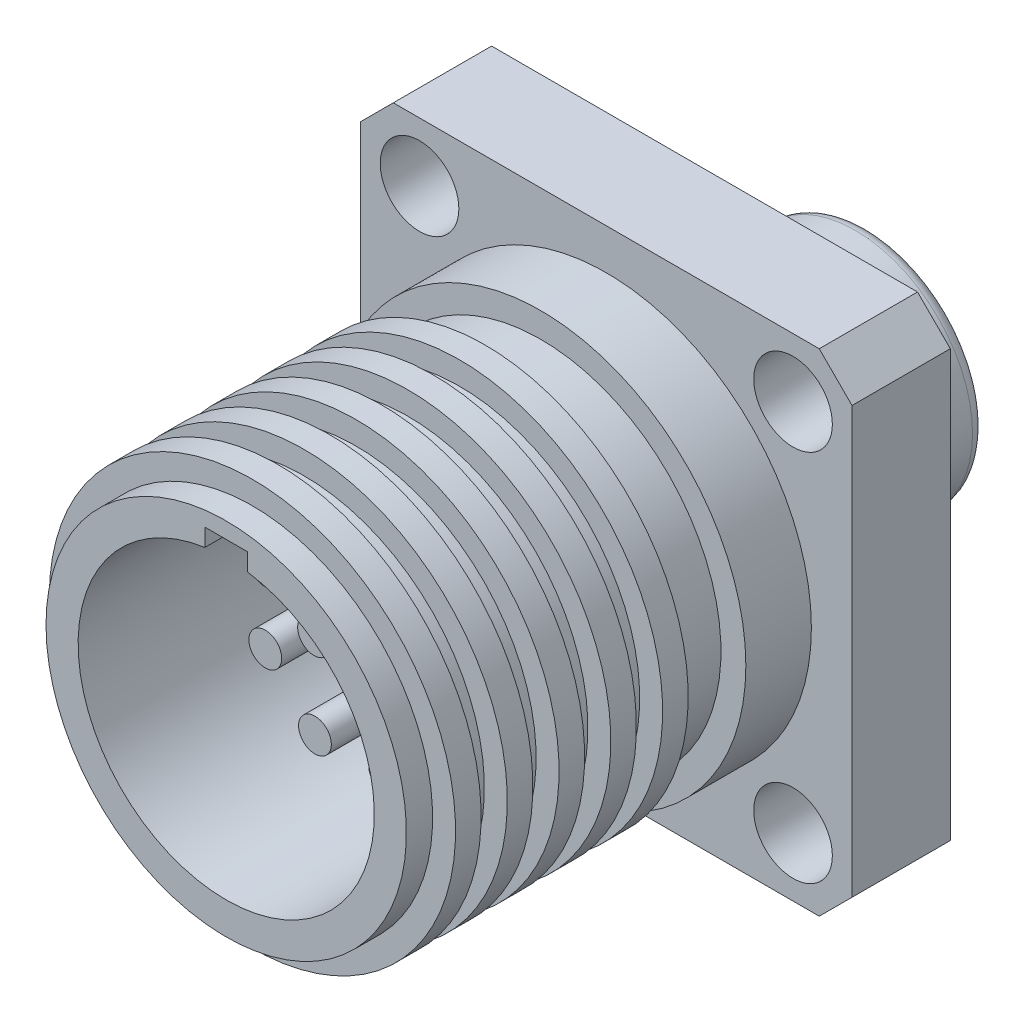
ISO-10303-21;
HEADER;
FILE_DESCRIPTION(('STEP AP214'),'2;1');
FILE_NAME('part.step','',(''),(''),'','','');
FILE_SCHEMA(('AUTOMOTIVE_DESIGN { 1 0 10303 214 1 1 1 1 }'));
ENDSEC;
DATA;
#1=APPLICATION_CONTEXT('core data for automotive mechanical design processes');
#2=APPLICATION_PROTOCOL_DEFINITION('international standard','automotive_design',2000,#1);
#3=PRODUCT_CONTEXT('',#1,'mechanical');
#4=PRODUCT('Part','Part','',(#3));
#5=PRODUCT_RELATED_PRODUCT_CATEGORY('part','',(#4));
#6=PRODUCT_DEFINITION_FORMATION('','',#4);
#7=PRODUCT_DEFINITION_CONTEXT('part definition',#1,'design');
#8=PRODUCT_DEFINITION('design','',#6,#7);
#9=PRODUCT_DEFINITION_SHAPE('','',#8);
#10=(LENGTH_UNIT() NAMED_UNIT(*) SI_UNIT(.MILLI.,.METRE.));
#11=(NAMED_UNIT(*) PLANE_ANGLE_UNIT() SI_UNIT($,.RADIAN.));
#12=(NAMED_UNIT(*) SI_UNIT($,.STERADIAN.) SOLID_ANGLE_UNIT());
#13=UNCERTAINTY_MEASURE_WITH_UNIT(LENGTH_MEASURE(1.E-05),#10,'distance_accuracy_value','');
#14=(GEOMETRIC_REPRESENTATION_CONTEXT(3) GLOBAL_UNCERTAINTY_ASSIGNED_CONTEXT((#13)) GLOBAL_UNIT_ASSIGNED_CONTEXT((#10,
#11,#12)) REPRESENTATION_CONTEXT('',''));
#15=CARTESIAN_POINT('',(0.,0.,0.));
#16=DIRECTION('',(0.,0.,1.));
#17=DIRECTION('',(1.,0.,0.));
#18=AXIS2_PLACEMENT_3D('',#15,#16,#17);
#19=CARTESIAN_POINT('',(-9.525,-9.525,0.));
#20=DIRECTION('',(0.,0.,1.));
#21=DIRECTION('',(1.,0.,0.));
#22=AXIS2_PLACEMENT_3D('',#19,#20,#21);
#23=PLANE('',#22);
#24=CARTESIAN_POINT('',(7.23899999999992,7.23900000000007,0.));
#25=DIRECTION('',(0.,0.,1.));
#26=DIRECTION('',(0.,-1.,0.));
#27=AXIS2_PLACEMENT_3D('',#24,#25,#26);
#28=CIRCLE('',#27,1.524);
#29=CARTESIAN_POINT('',(8.76299999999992,7.23900000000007,0.));
#30=VERTEX_POINT('',#29);
#31=EDGE_CURVE('E183',#30,#30,#28,.T.);
#32=ORIENTED_EDGE('',*,*,#31,.T.);
#33=EDGE_LOOP('',(#32));
#34=FACE_BOUND('',#33,.T.);
#35=CARTESIAN_POINT('',(7.239,-7.239,0.));
#36=DIRECTION('',(0.,0.,1.));
#37=DIRECTION('',(-1.,0.,0.));
#38=AXIS2_PLACEMENT_3D('',#35,#36,#37);
#39=CIRCLE('',#38,1.524);
#40=CARTESIAN_POINT('',(8.763,-7.239,0.));
#41=VERTEX_POINT('',#40);
#42=EDGE_CURVE('E189',#41,#41,#39,.T.);
#43=ORIENTED_EDGE('',*,*,#42,.T.);
#44=EDGE_LOOP('',(#43));
#45=FACE_BOUND('',#44,.T.);
#46=CARTESIAN_POINT('',(-7.23899999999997,-7.23900000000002,0.));
#47=DIRECTION('',(0.,0.,1.));
#48=DIRECTION('',(0.,1.,0.));
#49=AXIS2_PLACEMENT_3D('',#46,#47,#48);
#50=CIRCLE('',#49,1.524);
#51=CARTESIAN_POINT('',(-5.71499999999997,-7.23900000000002,0.));
#52=VERTEX_POINT('',#51);
#53=EDGE_CURVE('E195',#52,#52,#50,.T.);
#54=ORIENTED_EDGE('',*,*,#53,.T.);
#55=EDGE_LOOP('',(#54));
#56=FACE_BOUND('',#55,.T.);
#57=CARTESIAN_POINT('',(-7.239,7.239,0.));
#58=DIRECTION('',(0.,0.,1.));
#59=DIRECTION('',(1.,0.,0.));
#60=AXIS2_PLACEMENT_3D('',#57,#58,#59);
#61=CIRCLE('',#60,1.524);
#62=CARTESIAN_POINT('',(-5.715,7.239,0.));
#63=VERTEX_POINT('',#62);
#64=EDGE_CURVE('E201',#63,#63,#61,.T.);
#65=ORIENTED_EDGE('',*,*,#64,.T.);
#66=EDGE_LOOP('',(#65));
#67=FACE_BOUND('',#66,.T.);
#68=DIRECTION('',(1.,0.,0.));
#69=VECTOR('',#68,1.);
#70=CARTESIAN_POINT('',(-9.525,-9.525,0.));
#71=LINE('',#70,#69);
#72=CARTESIAN_POINT('',(-8.255,-9.525,0.));
#73=VERTEX_POINT('',#72);
#74=CARTESIAN_POINT('',(8.25499999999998,-9.525,0.));
#75=VERTEX_POINT('',#74);
#76=EDGE_CURVE('E222',#73,#75,#71,.T.);
#77=ORIENTED_EDGE('',*,*,#76,.F.);
#78=DIRECTION('',(0.707106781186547,-0.707106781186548,0.));
#79=VECTOR('',#78,1.);
#80=CARTESIAN_POINT('',(-8.255,-9.525,0.));
#81=LINE('',#80,#79);
#82=CARTESIAN_POINT('',(-9.525,-8.255,0.));
#83=VERTEX_POINT('',#82);
#84=EDGE_CURVE('E239',#73,#83,#81,.F.);
#85=ORIENTED_EDGE('',*,*,#84,.T.);
#86=DIRECTION('',(0.,-1.,0.));
#87=VECTOR('',#86,1.);
#88=CARTESIAN_POINT('',(-9.525,9.525,0.));
#89=LINE('',#88,#87);
#90=CARTESIAN_POINT('',(-9.525,8.255,0.));
#91=VERTEX_POINT('',#90);
#92=EDGE_CURVE('E204',#91,#83,#89,.T.);
#93=ORIENTED_EDGE('',*,*,#92,.F.);
#94=DIRECTION('',(-0.707106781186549,-0.707106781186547,0.));
#95=VECTOR('',#94,1.);
#96=CARTESIAN_POINT('',(-9.525,8.255,0.));
#97=LINE('',#96,#95);
#98=CARTESIAN_POINT('',(-8.25499999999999,9.525,0.));
#99=VERTEX_POINT('',#98);
#100=EDGE_CURVE('E235',#91,#99,#97,.F.);
#101=ORIENTED_EDGE('',*,*,#100,.T.);
#102=DIRECTION('',(-1.,0.,0.));
#103=VECTOR('',#102,1.);
#104=CARTESIAN_POINT('',(-9.525,9.525,0.));
#105=LINE('',#104,#103);
#106=CARTESIAN_POINT('',(8.255,9.525,0.));
#107=VERTEX_POINT('',#106);
#108=EDGE_CURVE('E211',#107,#99,#105,.T.);
#109=ORIENTED_EDGE('',*,*,#108,.F.);
#110=DIRECTION('',(-0.707106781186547,0.707106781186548,0.));
#111=VECTOR('',#110,1.);
#112=CARTESIAN_POINT('',(8.255,9.525,0.));
#113=LINE('',#112,#111);
#114=CARTESIAN_POINT('',(9.525,8.255,0.));
#115=VERTEX_POINT('',#114);
#116=EDGE_CURVE('E233',#107,#115,#113,.F.);
#117=ORIENTED_EDGE('',*,*,#116,.T.);
#118=DIRECTION('',(0.,1.,0.));
#119=VECTOR('',#118,1.);
#120=CARTESIAN_POINT('',(9.525,9.525,0.));
#121=LINE('',#120,#119);
#122=CARTESIAN_POINT('',(9.525,-8.255,0.));
#123=VERTEX_POINT('',#122);
#124=EDGE_CURVE('E225',#123,#115,#121,.T.);
#125=ORIENTED_EDGE('',*,*,#124,.F.);
#126=DIRECTION('',(0.70710678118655,0.707106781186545,0.));
#127=VECTOR('',#126,1.);
#128=CARTESIAN_POINT('',(9.525,-8.255,0.));
#129=LINE('',#128,#127);
#130=EDGE_CURVE('E237',#123,#75,#129,.F.);
#131=ORIENTED_EDGE('',*,*,#130,.T.);
#132=EDGE_LOOP('',(#77,#85,#93,#101,#109,#117,#125,#131));
#133=FACE_BOUND('',#132,.T.);
#134=CARTESIAN_POINT('',(0.,0.,0.));
#135=DIRECTION('',(0.,0.,1.));
#136=DIRECTION('',(1.,0.,0.));
#137=AXIS2_PLACEMENT_3D('',#134,#135,#136);
#138=CIRCLE('',#137,7.239);
#139=CARTESIAN_POINT('',(7.239,0.,0.));
#140=VERTEX_POINT('',#139);
#141=EDGE_CURVE('E381',#140,#140,#138,.T.);
#142=ORIENTED_EDGE('',*,*,#141,.T.);
#143=EDGE_LOOP('',(#142));
#144=FACE_BOUND('',#143,.T.);
#145=ADVANCED_FACE('F36',(#34,#45,#56,#67,#133,#144),#23,.F.);
#146=CARTESIAN_POINT('',(0.,0.,18.542));
#147=DIRECTION('',(0.,0.,-1.));
#148=DIRECTION('',(-1.,0.,0.));
#149=AXIS2_PLACEMENT_3D('',#146,#147,#148);
#150=CYLINDRICAL_SURFACE('',#149,6.985);
#151=CARTESIAN_POINT('',(0.,0.,10.5156));
#152=DIRECTION('',(0.,0.,1.));
#153=DIRECTION('',(1.,0.,0.));
#154=AXIS2_PLACEMENT_3D('',#151,#152,#153);
#155=CIRCLE('',#154,6.985);
#156=CARTESIAN_POINT('',(-6.985,0.,10.5156));
#157=VERTEX_POINT('',#156);
#158=EDGE_CURVE('E284',#157,#157,#155,.T.);
#159=CARTESIAN_POINT('',(0.,0.,9.4996));
#160=DIRECTION('',(0.,0.,-1.));
#161=DIRECTION('',(-1.,0.,0.));
#162=AXIS2_PLACEMENT_3D('',#159,#160,#161);
#163=CIRCLE('',#162,6.985);
#164=CARTESIAN_POINT('',(-6.985,0.,9.4996));
#165=VERTEX_POINT('',#164);
#166=EDGE_CURVE('E287',#165,#165,#163,.T.);
#167=CARTESIAN_POINT('',(-6.985,0.,10.5156));
#168=CARTESIAN_POINT('',(-6.985,0.,10.5050166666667));
#169=CARTESIAN_POINT('',(-6.985,0.,10.4944333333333));
#170=CARTESIAN_POINT('',(-6.985,0.,10.4732666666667));
#171=CARTESIAN_POINT('',(-6.985,0.,10.4626833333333));
#172=CARTESIAN_POINT('',(-6.985,0.,10.4415166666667));
#173=CARTESIAN_POINT('',(-6.985,0.,10.4309333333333));
#174=CARTESIAN_POINT('',(-6.985,0.,10.4097666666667));
#175=CARTESIAN_POINT('',(-6.985,0.,10.3991833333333));
#176=CARTESIAN_POINT('',(-6.985,0.,10.3780166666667));
#177=CARTESIAN_POINT('',(-6.985,0.,10.3674333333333));
#178=CARTESIAN_POINT('',(-6.985,0.,10.3462666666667));
#179=CARTESIAN_POINT('',(-6.985,0.,10.3356833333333));
#180=CARTESIAN_POINT('',(-6.985,0.,10.3145166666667));
#181=CARTESIAN_POINT('',(-6.985,0.,10.3039333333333));
#182=CARTESIAN_POINT('',(-6.985,0.,10.2827666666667));
#183=CARTESIAN_POINT('',(-6.985,0.,10.2721833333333));
#184=CARTESIAN_POINT('',(-6.985,0.,10.2510166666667));
#185=CARTESIAN_POINT('',(-6.985,0.,10.2404333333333));
#186=CARTESIAN_POINT('',(-6.985,0.,10.2192666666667));
#187=CARTESIAN_POINT('',(-6.985,0.,10.2086833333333));
#188=CARTESIAN_POINT('',(-6.985,0.,10.1875166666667));
#189=CARTESIAN_POINT('',(-6.985,0.,10.1769333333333));
#190=CARTESIAN_POINT('',(-6.985,0.,10.1557666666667));
#191=CARTESIAN_POINT('',(-6.985,0.,10.1451833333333));
#192=CARTESIAN_POINT('',(-6.985,0.,10.1240166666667));
#193=CARTESIAN_POINT('',(-6.985,0.,10.1134333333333));
#194=CARTESIAN_POINT('',(-6.985,0.,10.0922666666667));
#195=CARTESIAN_POINT('',(-6.985,0.,10.0816833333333));
#196=CARTESIAN_POINT('',(-6.985,0.,10.0605166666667));
#197=CARTESIAN_POINT('',(-6.985,0.,10.0499333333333));
#198=CARTESIAN_POINT('',(-6.985,0.,10.0287666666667));
#199=CARTESIAN_POINT('',(-6.985,0.,10.0181833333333));
#200=CARTESIAN_POINT('',(-6.985,0.,9.99701666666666));
#201=CARTESIAN_POINT('',(-6.985,0.,9.98643333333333));
#202=CARTESIAN_POINT('',(-6.985,0.,9.96526666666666));
#203=CARTESIAN_POINT('',(-6.985,0.,9.95468333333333));
#204=CARTESIAN_POINT('',(-6.985,0.,9.93351666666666));
#205=CARTESIAN_POINT('',(-6.985,0.,9.92293333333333));
#206=CARTESIAN_POINT('',(-6.985,0.,9.90176666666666));
#207=CARTESIAN_POINT('',(-6.985,0.,9.89118333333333));
#208=CARTESIAN_POINT('',(-6.985,0.,9.87001666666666));
#209=CARTESIAN_POINT('',(-6.985,0.,9.85943333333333));
#210=CARTESIAN_POINT('',(-6.985,0.,9.83826666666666));
#211=CARTESIAN_POINT('',(-6.985,0.,9.82768333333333));
#212=CARTESIAN_POINT('',(-6.985,0.,9.80651666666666));
#213=CARTESIAN_POINT('',(-6.985,0.,9.79593333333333));
#214=CARTESIAN_POINT('',(-6.985,0.,9.77476666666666));
#215=CARTESIAN_POINT('',(-6.985,0.,9.76418333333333));
#216=CARTESIAN_POINT('',(-6.985,0.,9.74301666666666));
#217=CARTESIAN_POINT('',(-6.985,0.,9.73243333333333));
#218=CARTESIAN_POINT('',(-6.985,0.,9.71126666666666));
#219=CARTESIAN_POINT('',(-6.985,0.,9.70068333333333));
#220=CARTESIAN_POINT('',(-6.985,0.,9.67951666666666));
#221=CARTESIAN_POINT('',(-6.985,0.,9.66893333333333));
#222=CARTESIAN_POINT('',(-6.985,0.,9.64776666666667));
#223=CARTESIAN_POINT('',(-6.985,0.,9.63718333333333));
#224=CARTESIAN_POINT('',(-6.985,0.,9.61601666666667));
#225=CARTESIAN_POINT('',(-6.985,0.,9.60543333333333));
#226=CARTESIAN_POINT('',(-6.985,0.,9.58426666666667));
#227=CARTESIAN_POINT('',(-6.985,0.,9.57368333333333));
#228=CARTESIAN_POINT('',(-6.985,0.,9.55251666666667));
#229=CARTESIAN_POINT('',(-6.985,0.,9.54193333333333));
#230=CARTESIAN_POINT('',(-6.985,0.,9.52076666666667));
#231=CARTESIAN_POINT('',(-6.985,0.,9.51018333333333));
#232=CARTESIAN_POINT('',(-6.985,0.,9.4996));
#233=B_SPLINE_CURVE_WITH_KNOTS('',3,(#167,#168,#169,#170,#171,#172,#173,#174,#175,#176,#177,
#178,#179,#180,#181,#182,#183,#184,#185,#186,#187,#188,#189,#190,#191,#192,#193,#194,#195,#196,
#197,#198,#199,#200,#201,#202,#203,#204,#205,#206,#207,#208,#209,#210,#211,#212,#213,#214,#215,
#216,#217,#218,#219,#220,#221,#222,#223,#224,#225,#226,#227,#228,#229,#230,#231,#232),
.UNSPECIFIED.,.F.,.F.,(4,2,2,2,2,2,2,2,2,2,2,2,2,2,2,2,2,2,2,2,2,2,2,2,2,2,2,2,2,2,2,2,4),(0.,
0.0317500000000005,0.0634999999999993,0.0952499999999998,0.126999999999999,0.158749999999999,
0.1905,0.222249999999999,0.253999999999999,0.28575,0.317499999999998,0.349249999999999,
0.380999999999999,0.412749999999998,0.444499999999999,0.476249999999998,0.507999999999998,
0.539749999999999,0.571499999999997,0.603249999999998,0.634999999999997,0.666749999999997,
0.698499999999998,0.730249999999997,0.761999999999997,0.793749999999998,0.825499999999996,
0.857249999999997,0.888999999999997,0.920749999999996,0.952499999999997,0.984249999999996,
1.016),.UNSPECIFIED.);
#234=EDGE_CURVE('BSEAM311',#157,#165,#233,.T.);
#235=ORIENTED_EDGE('',*,*,#158,.F.);
#236=ORIENTED_EDGE('',*,*,#166,.F.);
#237=ORIENTED_EDGE('',*,*,#234,.T.);
#238=ORIENTED_EDGE('',*,*,#234,.F.);
#239=EDGE_LOOP('',(#235,#237,#236,#238));
#240=FACE_BOUND('',#239,.T.);
#241=ADVANCED_FACE('F311',(#240),#150,.T.);
#242=CARTESIAN_POINT('',(0.,0.,12.5222));
#243=DIRECTION('',(0.,0.,1.));
#244=DIRECTION('',(1.,0.,0.));
#245=AXIS2_PLACEMENT_3D('',#242,#243,#244);
#246=CIRCLE('',#245,6.985);
#247=CARTESIAN_POINT('',(-6.985,0.,12.5222));
#248=VERTEX_POINT('',#247);
#249=EDGE_CURVE('E278',#248,#248,#246,.T.);
#250=CARTESIAN_POINT('',(0.,0.,11.5062));
#251=DIRECTION('',(0.,0.,-1.));
#252=DIRECTION('',(-1.,0.,0.));
#253=AXIS2_PLACEMENT_3D('',#250,#251,#252);
#254=CIRCLE('',#253,6.985);
#255=CARTESIAN_POINT('',(-6.985,0.,11.5062));
#256=VERTEX_POINT('',#255);
#257=EDGE_CURVE('E281',#256,#256,#254,.T.);
#258=CARTESIAN_POINT('',(-6.985,0.,12.5222));
#259=CARTESIAN_POINT('',(-6.985,0.,12.5116166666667));
#260=CARTESIAN_POINT('',(-6.985,0.,12.5010333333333));
#261=CARTESIAN_POINT('',(-6.985,0.,12.4798666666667));
#262=CARTESIAN_POINT('',(-6.985,0.,12.4692833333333));
#263=CARTESIAN_POINT('',(-6.985,0.,12.4481166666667));
#264=CARTESIAN_POINT('',(-6.985,0.,12.4375333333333));
#265=CARTESIAN_POINT('',(-6.985,0.,12.4163666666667));
#266=CARTESIAN_POINT('',(-6.985,0.,12.4057833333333));
#267=CARTESIAN_POINT('',(-6.985,0.,12.3846166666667));
#268=CARTESIAN_POINT('',(-6.985,0.,12.3740333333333));
#269=CARTESIAN_POINT('',(-6.985,0.,12.3528666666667));
#270=CARTESIAN_POINT('',(-6.985,0.,12.3422833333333));
#271=CARTESIAN_POINT('',(-6.985,0.,12.3211166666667));
#272=CARTESIAN_POINT('',(-6.985,0.,12.3105333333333));
#273=CARTESIAN_POINT('',(-6.985,0.,12.2893666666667));
#274=CARTESIAN_POINT('',(-6.985,0.,12.2787833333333));
#275=CARTESIAN_POINT('',(-6.985,0.,12.2576166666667));
#276=CARTESIAN_POINT('',(-6.985,0.,12.2470333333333));
#277=CARTESIAN_POINT('',(-6.985,0.,12.2258666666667));
#278=CARTESIAN_POINT('',(-6.985,0.,12.2152833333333));
#279=CARTESIAN_POINT('',(-6.985,0.,12.1941166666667));
#280=CARTESIAN_POINT('',(-6.985,0.,12.1835333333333));
#281=CARTESIAN_POINT('',(-6.985,0.,12.1623666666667));
#282=CARTESIAN_POINT('',(-6.985,0.,12.1517833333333));
#283=CARTESIAN_POINT('',(-6.985,0.,12.1306166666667));
#284=CARTESIAN_POINT('',(-6.985,0.,12.1200333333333));
#285=CARTESIAN_POINT('',(-6.985,0.,12.0988666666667));
#286=CARTESIAN_POINT('',(-6.985,0.,12.0882833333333));
#287=CARTESIAN_POINT('',(-6.985,0.,12.0671166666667));
#288=CARTESIAN_POINT('',(-6.985,0.,12.0565333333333));
#289=CARTESIAN_POINT('',(-6.985,0.,12.0353666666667));
#290=CARTESIAN_POINT('',(-6.985,0.,12.0247833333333));
#291=CARTESIAN_POINT('',(-6.985,0.,12.0036166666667));
#292=CARTESIAN_POINT('',(-6.985,0.,11.9930333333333));
#293=CARTESIAN_POINT('',(-6.985,0.,11.9718666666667));
#294=CARTESIAN_POINT('',(-6.985,0.,11.9612833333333));
#295=CARTESIAN_POINT('',(-6.985,0.,11.9401166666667));
#296=CARTESIAN_POINT('',(-6.985,0.,11.9295333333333));
#297=CARTESIAN_POINT('',(-6.985,0.,11.9083666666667));
#298=CARTESIAN_POINT('',(-6.985,0.,11.8977833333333));
#299=CARTESIAN_POINT('',(-6.985,0.,11.8766166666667));
#300=CARTESIAN_POINT('',(-6.985,0.,11.8660333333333));
#301=CARTESIAN_POINT('',(-6.985,0.,11.8448666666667));
#302=CARTESIAN_POINT('',(-6.985,0.,11.8342833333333));
#303=CARTESIAN_POINT('',(-6.985,0.,11.8131166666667));
#304=CARTESIAN_POINT('',(-6.985,0.,11.8025333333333));
#305=CARTESIAN_POINT('',(-6.985,0.,11.7813666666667));
#306=CARTESIAN_POINT('',(-6.985,0.,11.7707833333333));
#307=CARTESIAN_POINT('',(-6.985,0.,11.7496166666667));
#308=CARTESIAN_POINT('',(-6.985,0.,11.7390333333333));
#309=CARTESIAN_POINT('',(-6.985,0.,11.7178666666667));
#310=CARTESIAN_POINT('',(-6.985,0.,11.7072833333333));
#311=CARTESIAN_POINT('',(-6.985,0.,11.6861166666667));
#312=CARTESIAN_POINT('',(-6.985,0.,11.6755333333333));
#313=CARTESIAN_POINT('',(-6.985,0.,11.6543666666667));
#314=CARTESIAN_POINT('',(-6.985,0.,11.6437833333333));
#315=CARTESIAN_POINT('',(-6.985,0.,11.6226166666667));
#316=CARTESIAN_POINT('',(-6.985,0.,11.6120333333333));
#317=CARTESIAN_POINT('',(-6.985,0.,11.5908666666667));
#318=CARTESIAN_POINT('',(-6.985,0.,11.5802833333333));
#319=CARTESIAN_POINT('',(-6.985,0.,11.5591166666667));
#320=CARTESIAN_POINT('',(-6.985,0.,11.5485333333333));
#321=CARTESIAN_POINT('',(-6.985,0.,11.5273666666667));
#322=CARTESIAN_POINT('',(-6.985,0.,11.5167833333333));
#323=CARTESIAN_POINT('',(-6.985,0.,11.5062));
#324=B_SPLINE_CURVE_WITH_KNOTS('',3,(#258,#259,#260,#261,#262,#263,#264,#265,#266,#267,#268,
#269,#270,#271,#272,#273,#274,#275,#276,#277,#278,#279,#280,#281,#282,#283,#284,#285,#286,#287,
#288,#289,#290,#291,#292,#293,#294,#295,#296,#297,#298,#299,#300,#301,#302,#303,#304,#305,#306,
#307,#308,#309,#310,#311,#312,#313,#314,#315,#316,#317,#318,#319,#320,#321,#322,#323),
.UNSPECIFIED.,.F.,.F.,(4,2,2,2,2,2,2,2,2,2,2,2,2,2,2,2,2,2,2,2,2,2,2,2,2,2,2,2,2,2,2,2,4),(0.,
0.0317500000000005,0.0635000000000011,0.0952500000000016,0.127,0.158750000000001,0.1905,0.22225,
0.254000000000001,0.285750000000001,0.3175,0.349249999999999,0.380999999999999,0.41275,0.4445,
0.476250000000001,0.508,0.539749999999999,0.571499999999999,0.60325,0.635,0.666750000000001,
0.698499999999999,0.730249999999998,0.761999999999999,0.793749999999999,0.8255,0.85725,
0.888999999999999,0.920749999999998,0.952499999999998,0.984249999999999,1.016),.UNSPECIFIED.);
#325=EDGE_CURVE('BSEAM316',#248,#256,#324,.T.);
#326=ORIENTED_EDGE('',*,*,#249,.F.);
#327=ORIENTED_EDGE('',*,*,#257,.F.);
#328=ORIENTED_EDGE('',*,*,#325,.T.);
#329=ORIENTED_EDGE('',*,*,#325,.F.);
#330=EDGE_LOOP('',(#326,#328,#327,#329));
#331=FACE_BOUND('',#330,.T.);
#332=ADVANCED_FACE('F316',(#331),#150,.T.);
#333=CARTESIAN_POINT('',(0.,0.,14.5288));
#334=DIRECTION('',(0.,0.,1.));
#335=DIRECTION('',(1.,0.,0.));
#336=AXIS2_PLACEMENT_3D('',#333,#334,#335);
#337=CIRCLE('',#336,6.985);
#338=CARTESIAN_POINT('',(-6.985,0.,14.5288));
#339=VERTEX_POINT('',#338);
#340=EDGE_CURVE('E272',#339,#339,#337,.T.);
#341=CARTESIAN_POINT('',(0.,0.,13.5128));
#342=DIRECTION('',(0.,0.,-1.));
#343=DIRECTION('',(-1.,0.,0.));
#344=AXIS2_PLACEMENT_3D('',#341,#342,#343);
#345=CIRCLE('',#344,6.985);
#346=CARTESIAN_POINT('',(-6.985,0.,13.5128));
#347=VERTEX_POINT('',#346);
#348=EDGE_CURVE('E275',#347,#347,#345,.T.);
#349=CARTESIAN_POINT('',(-6.985,0.,14.5288));
#350=CARTESIAN_POINT('',(-6.985,0.,14.5182166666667));
#351=CARTESIAN_POINT('',(-6.985,0.,14.5076333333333));
#352=CARTESIAN_POINT('',(-6.985,0.,14.4864666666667));
#353=CARTESIAN_POINT('',(-6.985,0.,14.4758833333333));
#354=CARTESIAN_POINT('',(-6.985,0.,14.4547166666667));
#355=CARTESIAN_POINT('',(-6.985,0.,14.4441333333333));
#356=CARTESIAN_POINT('',(-6.985,0.,14.4229666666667));
#357=CARTESIAN_POINT('',(-6.985,0.,14.4123833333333));
#358=CARTESIAN_POINT('',(-6.985,0.,14.3912166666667));
#359=CARTESIAN_POINT('',(-6.985,0.,14.3806333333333));
#360=CARTESIAN_POINT('',(-6.985,0.,14.3594666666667));
#361=CARTESIAN_POINT('',(-6.985,0.,14.3488833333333));
#362=CARTESIAN_POINT('',(-6.985,0.,14.3277166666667));
#363=CARTESIAN_POINT('',(-6.985,0.,14.3171333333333));
#364=CARTESIAN_POINT('',(-6.985,0.,14.2959666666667));
#365=CARTESIAN_POINT('',(-6.985,0.,14.2853833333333));
#366=CARTESIAN_POINT('',(-6.985,0.,14.2642166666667));
#367=CARTESIAN_POINT('',(-6.985,0.,14.2536333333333));
#368=CARTESIAN_POINT('',(-6.985,0.,14.2324666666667));
#369=CARTESIAN_POINT('',(-6.985,0.,14.2218833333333));
#370=CARTESIAN_POINT('',(-6.985,0.,14.2007166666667));
#371=CARTESIAN_POINT('',(-6.985,0.,14.1901333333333));
#372=CARTESIAN_POINT('',(-6.985,0.,14.1689666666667));
#373=CARTESIAN_POINT('',(-6.985,0.,14.1583833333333));
#374=CARTESIAN_POINT('',(-6.985,0.,14.1372166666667));
#375=CARTESIAN_POINT('',(-6.985,0.,14.1266333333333));
#376=CARTESIAN_POINT('',(-6.985,0.,14.1054666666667));
#377=CARTESIAN_POINT('',(-6.985,0.,14.0948833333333));
#378=CARTESIAN_POINT('',(-6.985,0.,14.0737166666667));
#379=CARTESIAN_POINT('',(-6.985,0.,14.0631333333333));
#380=CARTESIAN_POINT('',(-6.985,0.,14.0419666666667));
#381=CARTESIAN_POINT('',(-6.985,0.,14.0313833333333));
#382=CARTESIAN_POINT('',(-6.985,0.,14.0102166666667));
#383=CARTESIAN_POINT('',(-6.985,0.,13.9996333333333));
#384=CARTESIAN_POINT('',(-6.985,0.,13.9784666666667));
#385=CARTESIAN_POINT('',(-6.985,0.,13.9678833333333));
#386=CARTESIAN_POINT('',(-6.985,0.,13.9467166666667));
#387=CARTESIAN_POINT('',(-6.985,0.,13.9361333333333));
#388=CARTESIAN_POINT('',(-6.985,0.,13.9149666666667));
#389=CARTESIAN_POINT('',(-6.985,0.,13.9043833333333));
#390=CARTESIAN_POINT('',(-6.985,0.,13.8832166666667));
#391=CARTESIAN_POINT('',(-6.985,0.,13.8726333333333));
#392=CARTESIAN_POINT('',(-6.985,0.,13.8514666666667));
#393=CARTESIAN_POINT('',(-6.985,0.,13.8408833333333));
#394=CARTESIAN_POINT('',(-6.985,0.,13.8197166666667));
#395=CARTESIAN_POINT('',(-6.985,0.,13.8091333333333));
#396=CARTESIAN_POINT('',(-6.985,0.,13.7879666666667));
#397=CARTESIAN_POINT('',(-6.985,0.,13.7773833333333));
#398=CARTESIAN_POINT('',(-6.985,0.,13.7562166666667));
#399=CARTESIAN_POINT('',(-6.985,0.,13.7456333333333));
#400=CARTESIAN_POINT('',(-6.985,0.,13.7244666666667));
#401=CARTESIAN_POINT('',(-6.985,0.,13.7138833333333));
#402=CARTESIAN_POINT('',(-6.985,0.,13.6927166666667));
#403=CARTESIAN_POINT('',(-6.985,0.,13.6821333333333));
#404=CARTESIAN_POINT('',(-6.985,0.,13.6609666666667));
#405=CARTESIAN_POINT('',(-6.985,0.,13.6503833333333));
#406=CARTESIAN_POINT('',(-6.985,0.,13.6292166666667));
#407=CARTESIAN_POINT('',(-6.985,0.,13.6186333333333));
#408=CARTESIAN_POINT('',(-6.985,0.,13.5974666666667));
#409=CARTESIAN_POINT('',(-6.985,0.,13.5868833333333));
#410=CARTESIAN_POINT('',(-6.985,0.,13.5657166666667));
#411=CARTESIAN_POINT('',(-6.985,0.,13.5551333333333));
#412=CARTESIAN_POINT('',(-6.985,0.,13.5339666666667));
#413=CARTESIAN_POINT('',(-6.985,0.,13.5233833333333));
#414=CARTESIAN_POINT('',(-6.985,0.,13.5128));
#415=B_SPLINE_CURVE_WITH_KNOTS('',3,(#349,#350,#351,#352,#353,#354,#355,#356,#357,#358,#359,
#360,#361,#362,#363,#364,#365,#366,#367,#368,#369,#370,#371,#372,#373,#374,#375,#376,#377,#378,
#379,#380,#381,#382,#383,#384,#385,#386,#387,#388,#389,#390,#391,#392,#393,#394,#395,#396,#397,
#398,#399,#400,#401,#402,#403,#404,#405,#406,#407,#408,#409,#410,#411,#412,#413,#414),
.UNSPECIFIED.,.F.,.F.,(4,2,2,2,2,2,2,2,2,2,2,2,2,2,2,2,2,2,2,2,2,2,2,2,2,2,2,2,2,2,2,2,4),(0.,
0.0317500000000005,0.0635000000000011,0.0952500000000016,0.127,0.158750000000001,0.1905,0.22225,
0.254000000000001,0.285750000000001,0.3175,0.349249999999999,0.380999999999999,0.41275,0.4445,
0.476250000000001,0.508,0.539749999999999,0.571499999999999,0.60325,0.635,0.666750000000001,
0.698499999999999,0.730249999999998,0.761999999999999,0.793749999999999,0.8255,0.85725,
0.888999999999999,0.920749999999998,0.952499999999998,0.984249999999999,1.016),.UNSPECIFIED.);
#416=EDGE_CURVE('BSEAM843',#339,#347,#415,.T.);
#417=ORIENTED_EDGE('',*,*,#340,.F.);
#418=ORIENTED_EDGE('',*,*,#348,.F.);
#419=ORIENTED_EDGE('',*,*,#416,.T.);
#420=ORIENTED_EDGE('',*,*,#416,.F.);
#421=EDGE_LOOP('',(#417,#419,#418,#420));
#422=FACE_BOUND('',#421,.T.);
#423=ADVANCED_FACE('F843',(#422),#150,.T.);
#424=CARTESIAN_POINT('',(0.,0.,16.5354));
#425=DIRECTION('',(0.,0.,1.));
#426=DIRECTION('',(1.,0.,0.));
#427=AXIS2_PLACEMENT_3D('',#424,#425,#426);
#428=CIRCLE('',#427,6.985);
#429=CARTESIAN_POINT('',(-6.985,0.,16.5354));
#430=VERTEX_POINT('',#429);
#431=EDGE_CURVE('E266',#430,#430,#428,.T.);
#432=CARTESIAN_POINT('',(0.,0.,15.5194));
#433=DIRECTION('',(0.,0.,-1.));
#434=DIRECTION('',(-1.,0.,0.));
#435=AXIS2_PLACEMENT_3D('',#432,#433,#434);
#436=CIRCLE('',#435,6.985);
#437=CARTESIAN_POINT('',(-6.985,0.,15.5194));
#438=VERTEX_POINT('',#437);
#439=EDGE_CURVE('E269',#438,#438,#436,.T.);
#440=CARTESIAN_POINT('',(-6.985,0.,16.5354));
#441=CARTESIAN_POINT('',(-6.985,0.,16.5248166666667));
#442=CARTESIAN_POINT('',(-6.985,0.,16.5142333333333));
#443=CARTESIAN_POINT('',(-6.985,0.,16.4930666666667));
#444=CARTESIAN_POINT('',(-6.985,0.,16.4824833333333));
#445=CARTESIAN_POINT('',(-6.985,0.,16.4613166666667));
#446=CARTESIAN_POINT('',(-6.985,0.,16.4507333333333));
#447=CARTESIAN_POINT('',(-6.985,0.,16.4295666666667));
#448=CARTESIAN_POINT('',(-6.985,0.,16.4189833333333));
#449=CARTESIAN_POINT('',(-6.985,0.,16.3978166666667));
#450=CARTESIAN_POINT('',(-6.985,0.,16.3872333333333));
#451=CARTESIAN_POINT('',(-6.985,0.,16.3660666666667));
#452=CARTESIAN_POINT('',(-6.985,0.,16.3554833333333));
#453=CARTESIAN_POINT('',(-6.985,0.,16.3343166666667));
#454=CARTESIAN_POINT('',(-6.985,0.,16.3237333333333));
#455=CARTESIAN_POINT('',(-6.985,0.,16.3025666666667));
#456=CARTESIAN_POINT('',(-6.985,0.,16.2919833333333));
#457=CARTESIAN_POINT('',(-6.985,0.,16.2708166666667));
#458=CARTESIAN_POINT('',(-6.985,0.,16.2602333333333));
#459=CARTESIAN_POINT('',(-6.985,0.,16.2390666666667));
#460=CARTESIAN_POINT('',(-6.985,0.,16.2284833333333));
#461=CARTESIAN_POINT('',(-6.985,0.,16.2073166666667));
#462=CARTESIAN_POINT('',(-6.985,0.,16.1967333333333));
#463=CARTESIAN_POINT('',(-6.985,0.,16.1755666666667));
#464=CARTESIAN_POINT('',(-6.985,0.,16.1649833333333));
#465=CARTESIAN_POINT('',(-6.985,0.,16.1438166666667));
#466=CARTESIAN_POINT('',(-6.985,0.,16.1332333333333));
#467=CARTESIAN_POINT('',(-6.985,0.,16.1120666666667));
#468=CARTESIAN_POINT('',(-6.985,0.,16.1014833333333));
#469=CARTESIAN_POINT('',(-6.985,0.,16.0803166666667));
#470=CARTESIAN_POINT('',(-6.985,0.,16.0697333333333));
#471=CARTESIAN_POINT('',(-6.985,0.,16.0485666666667));
#472=CARTESIAN_POINT('',(-6.985,0.,16.0379833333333));
#473=CARTESIAN_POINT('',(-6.985,0.,16.0168166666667));
#474=CARTESIAN_POINT('',(-6.985,0.,16.0062333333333));
#475=CARTESIAN_POINT('',(-6.985,0.,15.9850666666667));
#476=CARTESIAN_POINT('',(-6.985,0.,15.9744833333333));
#477=CARTESIAN_POINT('',(-6.985,0.,15.9533166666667));
#478=CARTESIAN_POINT('',(-6.985,0.,15.9427333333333));
#479=CARTESIAN_POINT('',(-6.985,0.,15.9215666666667));
#480=CARTESIAN_POINT('',(-6.985,0.,15.9109833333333));
#481=CARTESIAN_POINT('',(-6.985,0.,15.8898166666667));
#482=CARTESIAN_POINT('',(-6.985,0.,15.8792333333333));
#483=CARTESIAN_POINT('',(-6.985,0.,15.8580666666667));
#484=CARTESIAN_POINT('',(-6.985,0.,15.8474833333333));
#485=CARTESIAN_POINT('',(-6.985,0.,15.8263166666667));
#486=CARTESIAN_POINT('',(-6.985,0.,15.8157333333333));
#487=CARTESIAN_POINT('',(-6.985,0.,15.7945666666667));
#488=CARTESIAN_POINT('',(-6.985,0.,15.7839833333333));
#489=CARTESIAN_POINT('',(-6.985,0.,15.7628166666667));
#490=CARTESIAN_POINT('',(-6.985,0.,15.7522333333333));
#491=CARTESIAN_POINT('',(-6.985,0.,15.7310666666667));
#492=CARTESIAN_POINT('',(-6.985,0.,15.7204833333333));
#493=CARTESIAN_POINT('',(-6.985,0.,15.6993166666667));
#494=CARTESIAN_POINT('',(-6.985,0.,15.6887333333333));
#495=CARTESIAN_POINT('',(-6.985,0.,15.6675666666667));
#496=CARTESIAN_POINT('',(-6.985,0.,15.6569833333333));
#497=CARTESIAN_POINT('',(-6.985,0.,15.6358166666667));
#498=CARTESIAN_POINT('',(-6.985,0.,15.6252333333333));
#499=CARTESIAN_POINT('',(-6.985,0.,15.6040666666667));
#500=CARTESIAN_POINT('',(-6.985,0.,15.5934833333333));
#501=CARTESIAN_POINT('',(-6.985,0.,15.5723166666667));
#502=CARTESIAN_POINT('',(-6.985,0.,15.5617333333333));
#503=CARTESIAN_POINT('',(-6.985,0.,15.5405666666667));
#504=CARTESIAN_POINT('',(-6.985,0.,15.5299833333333));
#505=CARTESIAN_POINT('',(-6.985,0.,15.5194));
#506=B_SPLINE_CURVE_WITH_KNOTS('',3,(#440,#441,#442,#443,#444,#445,#446,#447,#448,#449,#450,
#451,#452,#453,#454,#455,#456,#457,#458,#459,#460,#461,#462,#463,#464,#465,#466,#467,#468,#469,
#470,#471,#472,#473,#474,#475,#476,#477,#478,#479,#480,#481,#482,#483,#484,#485,#486,#487,#488,
#489,#490,#491,#492,#493,#494,#495,#496,#497,#498,#499,#500,#501,#502,#503,#504,#505),
.UNSPECIFIED.,.F.,.F.,(4,2,2,2,2,2,2,2,2,2,2,2,2,2,2,2,2,2,2,2,2,2,2,2,2,2,2,2,2,2,2,2,4),(0.,
0.0317499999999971,0.0634999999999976,0.0952499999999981,0.126999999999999,0.158749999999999,
0.1905,0.222249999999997,0.253999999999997,0.285749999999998,0.317499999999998,
0.349249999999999,0.380999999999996,0.412749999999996,0.444499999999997,0.476249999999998,
0.507999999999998,0.539749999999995,0.571499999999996,0.603249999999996,0.634999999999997,
0.666749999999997,0.698499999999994,0.730249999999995,0.761999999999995,0.793749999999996,
0.825499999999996,0.857249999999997,0.888999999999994,0.920749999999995,0.952499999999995,
0.984249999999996,1.01599999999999),.UNSPECIFIED.);
#507=EDGE_CURVE('BSEAM824',#430,#438,#506,.T.);
#508=ORIENTED_EDGE('',*,*,#431,.F.);
#509=ORIENTED_EDGE('',*,*,#439,.F.);
#510=ORIENTED_EDGE('',*,*,#507,.T.);
#511=ORIENTED_EDGE('',*,*,#507,.F.);
#512=EDGE_LOOP('',(#508,#510,#509,#511));
#513=FACE_BOUND('',#512,.T.);
#514=ADVANCED_FACE('F824',(#513),#150,.T.);
#515=CARTESIAN_POINT('',(6.985,0.,16.5354));
#516=DIRECTION('',(0.,0.,1.));
#517=DIRECTION('',(1.,0.,0.));
#518=AXIS2_PLACEMENT_3D('',#515,#516,#517);
#519=PLANE('',#518);
#520=ORIENTED_EDGE('',*,*,#431,.T.);
#521=EDGE_LOOP('',(#520));
#522=FACE_BOUND('',#521,.T.);
#523=CARTESIAN_POINT('',(0.,0.,16.5354));
#524=DIRECTION('',(0.,0.,-1.));
#525=DIRECTION('',(-1.,0.,0.));
#526=AXIS2_PLACEMENT_3D('',#523,#524,#525);
#527=CIRCLE('',#526,7.87400000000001);
#528=CARTESIAN_POINT('',(-7.87400000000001,0.,16.5354));
#529=VERTEX_POINT('',#528);
#530=EDGE_CURVE('E433',#529,#529,#527,.T.);
#531=ORIENTED_EDGE('',*,*,#530,.T.);
#532=EDGE_LOOP('',(#531));
#533=FACE_BOUND('',#532,.T.);
#534=ADVANCED_FACE('F816',(#522,#533),#519,.F.);
#535=CARTESIAN_POINT('',(0.,0.,0.));
#536=DIRECTION('',(0.,0.,-1.));
#537=DIRECTION('',(-1.,0.,0.));
#538=AXIS2_PLACEMENT_3D('',#535,#536,#537);
#539=CYLINDRICAL_SURFACE('',#538,7.87400000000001);
#540=ORIENTED_EDGE('',*,*,#530,.F.);
#541=EDGE_LOOP('',(#540));
#542=FACE_BOUND('',#541,.T.);
#543=CARTESIAN_POINT('',(0.,0.,17.526));
#544=DIRECTION('',(0.,0.,-1.));
#545=DIRECTION('',(-1.,0.,0.));
#546=AXIS2_PLACEMENT_3D('',#543,#544,#545);
#547=CIRCLE('',#546,7.87400000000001);
#548=CARTESIAN_POINT('',(-7.87400000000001,0.,17.526));
#549=VERTEX_POINT('',#548);
#550=EDGE_CURVE('E430',#549,#549,#547,.T.);
#551=ORIENTED_EDGE('',*,*,#550,.T.);
#552=EDGE_LOOP('',(#551));
#553=FACE_BOUND('',#552,.T.);
#554=ADVANCED_FACE('F807',(#542,#553),#539,.T.);
#555=CARTESIAN_POINT('',(6.985,0.,17.526));
#556=DIRECTION('',(0.,0.,-1.));
#557=DIRECTION('',(-1.,0.,0.));
#558=AXIS2_PLACEMENT_3D('',#555,#556,#557);
#559=PLANE('',#558);
#560=ORIENTED_EDGE('',*,*,#550,.F.);
#561=EDGE_LOOP('',(#560));
#562=FACE_BOUND('',#561,.T.);
#563=CARTESIAN_POINT('',(0.,0.,17.526));
#564=DIRECTION('',(0.,0.,-1.));
#565=DIRECTION('',(-1.,0.,0.));
#566=AXIS2_PLACEMENT_3D('',#563,#564,#565);
#567=CIRCLE('',#566,6.985);
#568=CARTESIAN_POINT('',(-6.985,0.,17.526));
#569=VERTEX_POINT('',#568);
#570=EDGE_CURVE('E263',#569,#569,#567,.T.);
#571=ORIENTED_EDGE('',*,*,#570,.T.);
#572=EDGE_LOOP('',(#571));
#573=FACE_BOUND('',#572,.T.);
#574=ADVANCED_FACE('F800',(#562,#573),#559,.F.);
#575=CARTESIAN_POINT('',(3.28531561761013,1.36082228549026,13.7414));
#576=DIRECTION('',(0.,0.,1.));
#577=DIRECTION('',(1.,0.,0.));
#578=AXIS2_PLACEMENT_3D('',#575,#576,#577);
#579=PLANE('',#578);
#580=CARTESIAN_POINT('',(-1.397,0.,13.7414));
#581=DIRECTION('',(0.,0.,1.));
#582=DIRECTION('',(1.,0.,0.));
#583=AXIS2_PLACEMENT_3D('',#580,#581,#582);
#584=CIRCLE('',#583,0.635);
#585=CARTESIAN_POINT('',(-0.762,0.,13.7414));
#586=VERTEX_POINT('',#585);
#587=EDGE_CURVE('E439',#586,#586,#584,.T.);
#588=ORIENTED_EDGE('',*,*,#587,.T.);
#589=EDGE_LOOP('',(#588));
#590=FACE_BOUND('',#589,.T.);
#591=ADVANCED_FACE('F806',(#590),#579,.T.);
#592=CARTESIAN_POINT('',(1.3608222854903,3.28531561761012,13.7414));
#593=DIRECTION('',(0.,0.,1.));
#594=DIRECTION('',(0.707106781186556,0.707106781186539,0.));
#595=AXIS2_PLACEMENT_3D('',#592,#593,#594);
#596=PLANE('',#595);
#597=CARTESIAN_POINT('',(1.3608222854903,3.28531561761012,13.7414));
#598=DIRECTION('',(0.,0.,1.));
#599=DIRECTION('',(0.707106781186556,0.707106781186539,0.));
#600=AXIS2_PLACEMENT_3D('',#597,#598,#599);
#601=CIRCLE('',#600,0.634999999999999);
#602=CARTESIAN_POINT('',(1.80983509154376,3.73432842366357,13.7414));
#603=VERTEX_POINT('',#602);
#604=EDGE_CURVE('E449',#603,#603,#601,.T.);
#605=ORIENTED_EDGE('',*,*,#604,.T.);
#606=EDGE_LOOP('',(#605));
#607=FACE_BOUND('',#606,.T.);
#608=ADVANCED_FACE('F869',(#607),#596,.T.);
#609=CARTESIAN_POINT('',(-3.28531561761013,1.36082228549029,13.7414));
#610=DIRECTION('',(0.,0.,1.));
#611=DIRECTION('',(-0.707106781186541,0.707106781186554,0.));
#612=AXIS2_PLACEMENT_3D('',#609,#610,#611);
#613=PLANE('',#612);
#614=CARTESIAN_POINT('',(-3.28531561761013,1.36082228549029,13.7414));
#615=DIRECTION('',(0.,0.,1.));
#616=DIRECTION('',(-0.707106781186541,0.707106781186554,0.));
#617=AXIS2_PLACEMENT_3D('',#614,#615,#616);
#618=CIRCLE('',#617,0.634999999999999);
#619=CARTESIAN_POINT('',(-3.73432842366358,1.80983509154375,13.7414));
#620=VERTEX_POINT('',#619);
#621=EDGE_CURVE('E461',#620,#620,#618,.T.);
#622=ORIENTED_EDGE('',*,*,#621,.T.);
#623=EDGE_LOOP('',(#622));
#624=FACE_BOUND('',#623,.T.);
#625=ADVANCED_FACE('F907',(#624),#613,.T.);
#626=CARTESIAN_POINT('',(-1.36082228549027,-3.28531561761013,13.7414));
#627=DIRECTION('',(0.,0.,1.));
#628=DIRECTION('',(-0.707106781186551,-0.707106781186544,0.));
#629=AXIS2_PLACEMENT_3D('',#626,#627,#628);
#630=PLANE('',#629);
#631=CARTESIAN_POINT('',(-1.36082228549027,-3.28531561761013,13.7414));
#632=DIRECTION('',(0.,0.,1.));
#633=DIRECTION('',(-0.707106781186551,-0.707106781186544,0.));
#634=AXIS2_PLACEMENT_3D('',#631,#632,#633);
#635=CIRCLE('',#634,0.634999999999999);
#636=CARTESIAN_POINT('',(-1.80983509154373,-3.73432842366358,13.7414));
#637=VERTEX_POINT('',#636);
#638=EDGE_CURVE('E473',#637,#637,#635,.T.);
#639=ORIENTED_EDGE('',*,*,#638,.T.);
#640=EDGE_LOOP('',(#639));
#641=FACE_BOUND('',#640,.T.);
#642=ADVANCED_FACE('F947',(#641),#630,.T.);
#643=CARTESIAN_POINT('',(3.28531561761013,-1.36082228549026,13.7414));
#644=DIRECTION('',(0.,0.,1.));
#645=DIRECTION('',(0.707106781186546,-0.707106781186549,0.));
#646=AXIS2_PLACEMENT_3D('',#643,#644,#645);
#647=PLANE('',#646);
#648=CARTESIAN_POINT('',(3.28531561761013,-1.36082228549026,13.7414));
#649=DIRECTION('',(0.,0.,1.));
#650=DIRECTION('',(0.707106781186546,-0.707106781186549,0.));
#651=AXIS2_PLACEMENT_3D('',#648,#649,#650);
#652=CIRCLE('',#651,0.634999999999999);
#653=CARTESIAN_POINT('',(3.73432842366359,-1.80983509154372,13.7414));
#654=VERTEX_POINT('',#653);
#655=EDGE_CURVE('E485',#654,#654,#652,.T.);
#656=ORIENTED_EDGE('',*,*,#655,.T.);
#657=EDGE_LOOP('',(#656));
#658=FACE_BOUND('',#657,.T.);
#659=ADVANCED_FACE('F987',(#658),#647,.T.);
#660=CARTESIAN_POINT('',(3.28531561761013,1.36082228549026,13.7414));
#661=DIRECTION('',(0.,0.,1.));
#662=DIRECTION('',(1.,0.,0.));
#663=AXIS2_PLACEMENT_3D('',#660,#661,#662);
#664=PLANE('',#663);
#665=CARTESIAN_POINT('',(3.28531561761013,1.36082228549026,13.7414));
#666=DIRECTION('',(0.,0.,1.));
#667=DIRECTION('',(1.,0.,0.));
#668=AXIS2_PLACEMENT_3D('',#665,#666,#667);
#669=CIRCLE('',#668,0.634999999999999);
#670=CARTESIAN_POINT('',(3.92031561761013,1.36082228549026,13.7414));
#671=VERTEX_POINT('',#670);
#672=EDGE_CURVE('E161',#671,#671,#669,.T.);
#673=ORIENTED_EDGE('',*,*,#672,.T.);
#674=EDGE_LOOP('',(#673));
#675=FACE_BOUND('',#674,.T.);
#676=ADVANCED_FACE('F1007',(#675),#664,.T.);
#677=CARTESIAN_POINT('',(1.36082228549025,-3.28531561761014,13.7414));
#678=DIRECTION('',(0.,0.,1.));
#679=DIRECTION('',(0.,-1.,0.));
#680=AXIS2_PLACEMENT_3D('',#677,#678,#679);
#681=PLANE('',#680);
#682=CARTESIAN_POINT('',(1.36082228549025,-3.28531561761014,13.7414));
#683=DIRECTION('',(0.,0.,1.));
#684=DIRECTION('',(0.,-1.,0.));
#685=AXIS2_PLACEMENT_3D('',#682,#683,#684);
#686=CIRCLE('',#685,0.634999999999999);
#687=CARTESIAN_POINT('',(1.36082228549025,-3.92031561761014,13.7414));
#688=VERTEX_POINT('',#687);
#689=EDGE_CURVE('E479',#688,#688,#686,.T.);
#690=ORIENTED_EDGE('',*,*,#689,.T.);
#691=EDGE_LOOP('',(#690));
#692=FACE_BOUND('',#691,.T.);
#693=ADVANCED_FACE('F967',(#692),#681,.T.);
#694=CARTESIAN_POINT('',(-3.28531561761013,-1.36082228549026,13.7414));
#695=DIRECTION('',(0.,0.,1.));
#696=DIRECTION('',(-1.,0.,0.));
#697=AXIS2_PLACEMENT_3D('',#694,#695,#696);
#698=PLANE('',#697);
#699=CARTESIAN_POINT('',(-3.28531561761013,-1.36082228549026,13.7414));
#700=DIRECTION('',(0.,0.,1.));
#701=DIRECTION('',(-1.,0.,0.));
#702=AXIS2_PLACEMENT_3D('',#699,#700,#701);
#703=CIRCLE('',#702,0.634999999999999);
#704=CARTESIAN_POINT('',(-3.92031561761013,-1.36082228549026,13.7414));
#705=VERTEX_POINT('',#704);
#706=EDGE_CURVE('E467',#705,#705,#703,.T.);
#707=ORIENTED_EDGE('',*,*,#706,.T.);
#708=EDGE_LOOP('',(#707));
#709=FACE_BOUND('',#708,.T.);
#710=ADVANCED_FACE('F927',(#709),#698,.T.);
#711=CARTESIAN_POINT('',(-1.36082228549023,3.28531561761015,13.7414));
#712=DIRECTION('',(0.,0.,1.));
#713=DIRECTION('',(0.,1.,0.));
#714=AXIS2_PLACEMENT_3D('',#711,#712,#713);
#715=PLANE('',#714);
#716=CARTESIAN_POINT('',(-1.36082228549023,3.28531561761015,13.7414));
#717=DIRECTION('',(0.,0.,1.));
#718=DIRECTION('',(0.,1.,0.));
#719=AXIS2_PLACEMENT_3D('',#716,#717,#718);
#720=CIRCLE('',#719,0.634999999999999);
#721=CARTESIAN_POINT('',(-1.36082228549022,3.92031561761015,13.7414));
#722=VERTEX_POINT('',#721);
#723=EDGE_CURVE('E455',#722,#722,#720,.T.);
#724=ORIENTED_EDGE('',*,*,#723,.T.);
#725=EDGE_LOOP('',(#724));
#726=FACE_BOUND('',#725,.T.);
#727=ADVANCED_FACE('F889',(#726),#715,.T.);
#728=CARTESIAN_POINT('',(3.28531561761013,1.36082228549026,13.7414));
#729=DIRECTION('',(0.,0.,1.));
#730=DIRECTION('',(1.,0.,0.));
#731=AXIS2_PLACEMENT_3D('',#728,#729,#730);
#732=PLANE('',#731);
#733=CARTESIAN_POINT('',(1.397,0.,13.7414));
#734=DIRECTION('',(0.,0.,1.));
#735=DIRECTION('',(1.,0.,0.));
#736=AXIS2_PLACEMENT_3D('',#733,#734,#735);
#737=CIRCLE('',#736,0.635);
#738=CARTESIAN_POINT('',(2.032,0.,13.7414));
#739=VERTEX_POINT('',#738);
#740=EDGE_CURVE('E445',#739,#739,#737,.T.);
#741=ORIENTED_EDGE('',*,*,#740,.T.);
#742=EDGE_LOOP('',(#741));
#743=FACE_BOUND('',#742,.T.);
#744=ADVANCED_FACE('F880',(#743),#732,.T.);
#745=CARTESIAN_POINT('',(-1.397,0.,15.5374512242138));
#746=DIRECTION('',(0.,0.,-1.));
#747=DIRECTION('',(-1.,0.,0.));
#748=AXIS2_PLACEMENT_3D('',#745,#746,#747);
#749=CYLINDRICAL_SURFACE('',#748,0.635);
#750=CARTESIAN_POINT('',(-1.397,0.,8.4582));
#751=DIRECTION('',(0.,0.,1.));
#752=DIRECTION('',(1.,0.,0.));
#753=AXIS2_PLACEMENT_3D('',#750,#751,#752);
#754=CIRCLE('',#753,0.635);
#755=CARTESIAN_POINT('',(-0.762,0.,8.4582));
#756=VERTEX_POINT('',#755);
#757=EDGE_CURVE('E436',#756,#756,#754,.T.);
#758=ORIENTED_EDGE('',*,*,#757,.T.);
#759=EDGE_LOOP('',(#758));
#760=FACE_BOUND('',#759,.T.);
#761=ORIENTED_EDGE('',*,*,#587,.F.);
#762=EDGE_LOOP('',(#761));
#763=FACE_BOUND('',#762,.T.);
#764=ADVANCED_FACE('F874',(#760,#763),#749,.T.);
#765=CARTESIAN_POINT('',(1.3608222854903,3.28531561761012,13.7414));
#766=DIRECTION('',(0.,0.,-1.));
#767=DIRECTION('',(-1.,0.,0.));
#768=AXIS2_PLACEMENT_3D('',#765,#766,#767);
#769=CYLINDRICAL_SURFACE('',#768,0.634999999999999);
#770=ORIENTED_EDGE('',*,*,#604,.F.);
#771=EDGE_LOOP('',(#770));
#772=FACE_BOUND('',#771,.T.);
#773=CARTESIAN_POINT('',(1.3608222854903,3.28531561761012,8.4582));
#774=DIRECTION('',(0.,0.,1.));
#775=DIRECTION('',(0.707106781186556,0.707106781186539,0.));
#776=AXIS2_PLACEMENT_3D('',#773,#774,#775);
#777=CIRCLE('',#776,0.634999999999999);
#778=CARTESIAN_POINT('',(1.80983509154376,3.73432842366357,8.4582));
#779=VERTEX_POINT('',#778);
#780=EDGE_CURVE('E448',#779,#779,#777,.T.);
#781=ORIENTED_EDGE('',*,*,#780,.T.);
#782=EDGE_LOOP('',(#781));
#783=FACE_BOUND('',#782,.T.);
#784=ADVANCED_FACE('F879',(#772,#783),#769,.T.);
#785=CARTESIAN_POINT('',(-3.28531561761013,1.36082228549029,13.7414));
#786=DIRECTION('',(0.,0.,-1.));
#787=DIRECTION('',(-1.,0.,0.));
#788=AXIS2_PLACEMENT_3D('',#785,#786,#787);
#789=CYLINDRICAL_SURFACE('',#788,0.634999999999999);
#790=ORIENTED_EDGE('',*,*,#621,.F.);
#791=EDGE_LOOP('',(#790));
#792=FACE_BOUND('',#791,.T.);
#793=CARTESIAN_POINT('',(-3.28531561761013,1.36082228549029,8.4582));
#794=DIRECTION('',(0.,0.,1.));
#795=DIRECTION('',(-0.707106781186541,0.707106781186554,0.));
#796=AXIS2_PLACEMENT_3D('',#793,#794,#795);
#797=CIRCLE('',#796,0.634999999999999);
#798=CARTESIAN_POINT('',(-3.73432842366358,1.80983509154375,8.4582));
#799=VERTEX_POINT('',#798);
#800=EDGE_CURVE('E458',#799,#799,#797,.T.);
#801=ORIENTED_EDGE('',*,*,#800,.T.);
#802=EDGE_LOOP('',(#801));
#803=FACE_BOUND('',#802,.T.);
#804=ADVANCED_FACE('F917',(#792,#803),#789,.T.);
#805=CARTESIAN_POINT('',(-1.36082228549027,-3.28531561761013,13.7414));
#806=DIRECTION('',(0.,0.,-1.));
#807=DIRECTION('',(-1.,0.,0.));
#808=AXIS2_PLACEMENT_3D('',#805,#806,#807);
#809=CYLINDRICAL_SURFACE('',#808,0.634999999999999);
#810=ORIENTED_EDGE('',*,*,#638,.F.);
#811=EDGE_LOOP('',(#810));
#812=FACE_BOUND('',#811,.T.);
#813=CARTESIAN_POINT('',(-1.36082228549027,-3.28531561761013,8.4582));
#814=DIRECTION('',(0.,0.,1.));
#815=DIRECTION('',(-0.707106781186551,-0.707106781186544,0.));
#816=AXIS2_PLACEMENT_3D('',#813,#814,#815);
#817=CIRCLE('',#816,0.634999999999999);
#818=CARTESIAN_POINT('',(-1.80983509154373,-3.73432842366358,8.4582));
#819=VERTEX_POINT('',#818);
#820=EDGE_CURVE('E470',#819,#819,#817,.T.);
#821=ORIENTED_EDGE('',*,*,#820,.T.);
#822=EDGE_LOOP('',(#821));
#823=FACE_BOUND('',#822,.T.);
#824=ADVANCED_FACE('F957',(#812,#823),#809,.T.);
#825=CARTESIAN_POINT('',(3.28531561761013,-1.36082228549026,13.7414));
#826=DIRECTION('',(0.,0.,-1.));
#827=DIRECTION('',(-1.,0.,0.));
#828=AXIS2_PLACEMENT_3D('',#825,#826,#827);
#829=CYLINDRICAL_SURFACE('',#828,0.634999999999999);
#830=ORIENTED_EDGE('',*,*,#655,.F.);
#831=EDGE_LOOP('',(#830));
#832=FACE_BOUND('',#831,.T.);
#833=CARTESIAN_POINT('',(3.28531561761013,-1.36082228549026,8.4582));
#834=DIRECTION('',(0.,0.,1.));
#835=DIRECTION('',(0.707106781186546,-0.707106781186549,0.));
#836=AXIS2_PLACEMENT_3D('',#833,#834,#835);
#837=CIRCLE('',#836,0.634999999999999);
#838=CARTESIAN_POINT('',(3.73432842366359,-1.80983509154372,8.4582));
#839=VERTEX_POINT('',#838);
#840=EDGE_CURVE('E482',#839,#839,#837,.T.);
#841=ORIENTED_EDGE('',*,*,#840,.T.);
#842=EDGE_LOOP('',(#841));
#843=FACE_BOUND('',#842,.T.);
#844=ADVANCED_FACE('F997',(#832,#843),#829,.T.);
#845=CARTESIAN_POINT('',(3.28531561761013,1.36082228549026,13.7414));
#846=DIRECTION('',(0.,0.,-1.));
#847=DIRECTION('',(-1.,0.,0.));
#848=AXIS2_PLACEMENT_3D('',#845,#846,#847);
#849=CYLINDRICAL_SURFACE('',#848,0.634999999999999);
#850=ORIENTED_EDGE('',*,*,#672,.F.);
#851=EDGE_LOOP('',(#850));
#852=FACE_BOUND('',#851,.T.);
#853=CARTESIAN_POINT('',(3.28531561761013,1.36082228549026,8.4582));
#854=DIRECTION('',(0.,0.,1.));
#855=DIRECTION('',(1.,0.,0.));
#856=AXIS2_PLACEMENT_3D('',#853,#854,#855);
#857=CIRCLE('',#856,0.634999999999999);
#858=CARTESIAN_POINT('',(3.92031561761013,1.36082228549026,8.4582));
#859=VERTEX_POINT('',#858);
#860=EDGE_CURVE('E154',#859,#859,#857,.T.);
#861=ORIENTED_EDGE('',*,*,#860,.T.);
#862=EDGE_LOOP('',(#861));
#863=FACE_BOUND('',#862,.T.);
#864=ADVANCED_FACE('F495',(#852,#863),#849,.T.);
#865=CARTESIAN_POINT('',(1.36082228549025,-3.28531561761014,13.7414));
#866=DIRECTION('',(0.,0.,-1.));
#867=DIRECTION('',(-1.,0.,0.));
#868=AXIS2_PLACEMENT_3D('',#865,#866,#867);
#869=CYLINDRICAL_SURFACE('',#868,0.634999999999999);
#870=ORIENTED_EDGE('',*,*,#689,.F.);
#871=EDGE_LOOP('',(#870));
#872=FACE_BOUND('',#871,.T.);
#873=CARTESIAN_POINT('',(1.36082228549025,-3.28531561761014,8.4582));
#874=DIRECTION('',(0.,0.,1.));
#875=DIRECTION('',(0.,-1.,0.));
#876=AXIS2_PLACEMENT_3D('',#873,#874,#875);
#877=CIRCLE('',#876,0.634999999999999);
#878=CARTESIAN_POINT('',(1.36082228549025,-3.92031561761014,8.4582));
#879=VERTEX_POINT('',#878);
#880=EDGE_CURVE('E476',#879,#879,#877,.T.);
#881=ORIENTED_EDGE('',*,*,#880,.T.);
#882=EDGE_LOOP('',(#881));
#883=FACE_BOUND('',#882,.T.);
#884=ADVANCED_FACE('F977',(#872,#883),#869,.T.);
#885=CARTESIAN_POINT('',(-3.28531561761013,-1.36082228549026,13.7414));
#886=DIRECTION('',(0.,0.,-1.));
#887=DIRECTION('',(-1.,0.,0.));
#888=AXIS2_PLACEMENT_3D('',#885,#886,#887);
#889=CYLINDRICAL_SURFACE('',#888,0.634999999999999);
#890=ORIENTED_EDGE('',*,*,#706,.F.);
#891=EDGE_LOOP('',(#890));
#892=FACE_BOUND('',#891,.T.);
#893=CARTESIAN_POINT('',(-3.28531561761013,-1.36082228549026,8.4582));
#894=DIRECTION('',(0.,0.,1.));
#895=DIRECTION('',(-1.,0.,0.));
#896=AXIS2_PLACEMENT_3D('',#893,#894,#895);
#897=CIRCLE('',#896,0.634999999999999);
#898=CARTESIAN_POINT('',(-3.92031561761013,-1.36082228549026,8.4582));
#899=VERTEX_POINT('',#898);
#900=EDGE_CURVE('E464',#899,#899,#897,.T.);
#901=ORIENTED_EDGE('',*,*,#900,.T.);
#902=EDGE_LOOP('',(#901));
#903=FACE_BOUND('',#902,.T.);
#904=ADVANCED_FACE('F937',(#892,#903),#889,.T.);
#905=CARTESIAN_POINT('',(-1.36082228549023,3.28531561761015,13.7414));
#906=DIRECTION('',(0.,0.,-1.));
#907=DIRECTION('',(-1.,0.,0.));
#908=AXIS2_PLACEMENT_3D('',#905,#906,#907);
#909=CYLINDRICAL_SURFACE('',#908,0.634999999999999);
#910=ORIENTED_EDGE('',*,*,#723,.F.);
#911=EDGE_LOOP('',(#910));
#912=FACE_BOUND('',#911,.T.);
#913=CARTESIAN_POINT('',(-1.36082228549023,3.28531561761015,8.4582));
#914=DIRECTION('',(0.,0.,1.));
#915=DIRECTION('',(0.,1.,0.));
#916=AXIS2_PLACEMENT_3D('',#913,#914,#915);
#917=CIRCLE('',#916,0.634999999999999);
#918=CARTESIAN_POINT('',(-1.36082228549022,3.92031561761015,8.4582));
#919=VERTEX_POINT('',#918);
#920=EDGE_CURVE('E452',#919,#919,#917,.T.);
#921=ORIENTED_EDGE('',*,*,#920,.T.);
#922=EDGE_LOOP('',(#921));
#923=FACE_BOUND('',#922,.T.);
#924=ADVANCED_FACE('F507',(#912,#923),#909,.T.);
#925=CARTESIAN_POINT('',(1.397,0.,15.5374512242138));
#926=DIRECTION('',(0.,0.,-1.));
#927=DIRECTION('',(-1.,0.,0.));
#928=AXIS2_PLACEMENT_3D('',#925,#926,#927);
#929=CYLINDRICAL_SURFACE('',#928,0.635);
#930=CARTESIAN_POINT('',(1.397,0.,8.4582));
#931=DIRECTION('',(0.,0.,1.));
#932=DIRECTION('',(1.,0.,0.));
#933=AXIS2_PLACEMENT_3D('',#930,#931,#932);
#934=CIRCLE('',#933,0.635);
#935=CARTESIAN_POINT('',(2.032,0.,8.4582));
#936=VERTEX_POINT('',#935);
#937=EDGE_CURVE('E442',#936,#936,#934,.T.);
#938=ORIENTED_EDGE('',*,*,#937,.T.);
#939=EDGE_LOOP('',(#938));
#940=FACE_BOUND('',#939,.T.);
#941=ORIENTED_EDGE('',*,*,#740,.F.);
#942=EDGE_LOOP('',(#941));
#943=FACE_BOUND('',#942,.T.);
#944=ADVANCED_FACE('F498',(#940,#943),#929,.T.);
#945=CARTESIAN_POINT('',(0.,0.,8.4582));
#946=DIRECTION('',(0.,0.,1.));
#947=DIRECTION('',(1.,0.,0.));
#948=AXIS2_PLACEMENT_3D('',#945,#946,#947);
#949=PLANE('',#948);
#950=ORIENTED_EDGE('',*,*,#937,.F.);
#951=EDGE_LOOP('',(#950));
#952=FACE_BOUND('',#951,.T.);
#953=ORIENTED_EDGE('',*,*,#920,.F.);
#954=EDGE_LOOP('',(#953));
#955=FACE_BOUND('',#954,.T.);
#956=ORIENTED_EDGE('',*,*,#900,.F.);
#957=EDGE_LOOP('',(#956));
#958=FACE_BOUND('',#957,.T.);
#959=ORIENTED_EDGE('',*,*,#880,.F.);
#960=EDGE_LOOP('',(#959));
#961=FACE_BOUND('',#960,.T.);
#962=ORIENTED_EDGE('',*,*,#860,.F.);
#963=EDGE_LOOP('',(#962));
#964=FACE_BOUND('',#963,.T.);
#965=DIRECTION('',(0.,-1.,0.));
#966=VECTOR('',#965,1.);
#967=CARTESIAN_POINT('',(-0.8255,6.3616863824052,8.4582));
#968=LINE('',#967,#966);
#969=CARTESIAN_POINT('',(-0.8255,6.3616863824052,8.4582));
#970=VERTEX_POINT('',#969);
#971=CARTESIAN_POINT('',(-0.8255,5.68073427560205,8.4582));
#972=VERTEX_POINT('',#971);
#973=EDGE_CURVE('E129',#970,#972,#968,.T.);
#974=ORIENTED_EDGE('',*,*,#973,.T.);
#975=CARTESIAN_POINT('',(0.,0.,8.4582));
#976=DIRECTION('',(0.,0.,1.));
#977=DIRECTION('',(1.,0.,0.));
#978=AXIS2_PLACEMENT_3D('',#975,#976,#977);
#979=CIRCLE('',#978,5.7404);
#980=CARTESIAN_POINT('',(0.8255,5.68073427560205,8.4582));
#981=VERTEX_POINT('',#980);
#982=EDGE_CURVE('E138',#972,#981,#979,.T.);
#983=ORIENTED_EDGE('',*,*,#982,.T.);
#984=DIRECTION('',(0.,1.,0.));
#985=VECTOR('',#984,1.);
#986=CARTESIAN_POINT('',(0.8255,6.3616863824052,8.4582));
#987=LINE('',#986,#985);
#988=CARTESIAN_POINT('',(0.8255,6.3616863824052,8.4582));
#989=VERTEX_POINT('',#988);
#990=EDGE_CURVE('E143',#981,#989,#987,.T.);
#991=ORIENTED_EDGE('',*,*,#990,.T.);
#992=DIRECTION('',(-1.,0.,0.));
#993=VECTOR('',#992,1.);
#994=CARTESIAN_POINT('',(-0.8255,6.3616863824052,8.4582));
#995=LINE('',#994,#993);
#996=EDGE_CURVE('E135',#989,#970,#995,.T.);
#997=ORIENTED_EDGE('',*,*,#996,.T.);
#998=EDGE_LOOP('',(#974,#983,#991,#997));
#999=FACE_BOUND('',#998,.T.);
#1000=ORIENTED_EDGE('',*,*,#840,.F.);
#1001=EDGE_LOOP('',(#1000));
#1002=FACE_BOUND('',#1001,.T.);
#1003=ORIENTED_EDGE('',*,*,#820,.F.);
#1004=EDGE_LOOP('',(#1003));
#1005=FACE_BOUND('',#1004,.T.);
#1006=ORIENTED_EDGE('',*,*,#800,.F.);
#1007=EDGE_LOOP('',(#1006));
#1008=FACE_BOUND('',#1007,.T.);
#1009=ORIENTED_EDGE('',*,*,#780,.F.);
#1010=EDGE_LOOP('',(#1009));
#1011=FACE_BOUND('',#1010,.T.);
#1012=ORIENTED_EDGE('',*,*,#757,.F.);
#1013=EDGE_LOOP('',(#1012));
#1014=FACE_BOUND('',#1013,.T.);
#1015=ADVANCED_FACE('F145',(#952,#955,#958,#961,#964,#999,#1002,#1005,#1008,#1011,#1014),#949,.T.);
#1016=CARTESIAN_POINT('',(0.,0.,8.4582));
#1017=DIRECTION('',(0.,0.,1.));
#1018=DIRECTION('',(1.,0.,0.));
#1019=AXIS2_PLACEMENT_3D('',#1016,#1017,#1018);
#1020=CYLINDRICAL_SURFACE('',#1019,5.7404);
#1021=CARTESIAN_POINT('',(0.,0.,18.542));
#1022=DIRECTION('',(0.,0.,1.));
#1023=DIRECTION('',(1.,0.,0.));
#1024=AXIS2_PLACEMENT_3D('',#1021,#1022,#1023);
#1025=CIRCLE('',#1024,5.7404);
#1026=CARTESIAN_POINT('',(-0.8255,5.68073427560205,18.542));
#1027=VERTEX_POINT('',#1026);
#1028=CARTESIAN_POINT('',(0.8255,5.68073427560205,18.542));
#1029=VERTEX_POINT('',#1028);
#1030=EDGE_CURVE('E160',#1027,#1029,#1025,.T.);
#1031=ORIENTED_EDGE('',*,*,#1030,.T.);
#1032=DIRECTION('',(0.,0.,1.));
#1033=VECTOR('',#1032,1.);
#1034=CARTESIAN_POINT('',(0.8255,5.68073427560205,8.4582));
#1035=LINE('',#1034,#1033);
#1036=EDGE_CURVE('E134',#981,#1029,#1035,.T.);
#1037=ORIENTED_EDGE('',*,*,#1036,.F.);
#1038=ORIENTED_EDGE('',*,*,#982,.F.);
#1039=DIRECTION('',(0.,0.,1.));
#1040=VECTOR('',#1039,1.);
#1041=CARTESIAN_POINT('',(-0.8255,5.68073427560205,8.4582));
#1042=LINE('',#1041,#1040);
#1043=EDGE_CURVE('E125',#972,#1027,#1042,.T.);
#1044=ORIENTED_EDGE('',*,*,#1043,.T.);
#1045=EDGE_LOOP('',(#1031,#1037,#1038,#1044));
#1046=FACE_BOUND('',#1045,.T.);
#1047=ADVANCED_FACE('F139',(#1046),#1020,.F.);
#1048=CARTESIAN_POINT('',(0.8255,6.3616863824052,8.4582));
#1049=DIRECTION('',(1.,0.,0.));
#1050=DIRECTION('',(0.,1.,0.));
#1051=AXIS2_PLACEMENT_3D('',#1048,#1049,#1050);
#1052=PLANE('',#1051);
#1053=DIRECTION('',(0.,1.,0.));
#1054=VECTOR('',#1053,1.);
#1055=CARTESIAN_POINT('',(0.8255,6.3616863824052,18.542));
#1056=LINE('',#1055,#1054);
#1057=CARTESIAN_POINT('',(0.8255,6.3616863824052,18.542));
#1058=VERTEX_POINT('',#1057);
#1059=EDGE_CURVE('E151',#1029,#1058,#1056,.T.);
#1060=ORIENTED_EDGE('',*,*,#1059,.T.);
#1061=DIRECTION('',(0.,0.,1.));
#1062=VECTOR('',#1061,1.);
#1063=CARTESIAN_POINT('',(0.8255,6.3616863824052,8.4582));
#1064=LINE('',#1063,#1062);
#1065=EDGE_CURVE('E168',#989,#1058,#1064,.T.);
#1066=ORIENTED_EDGE('',*,*,#1065,.F.);
#1067=ORIENTED_EDGE('',*,*,#990,.F.);
#1068=ORIENTED_EDGE('',*,*,#1036,.T.);
#1069=EDGE_LOOP('',(#1060,#1066,#1067,#1068));
#1070=FACE_BOUND('',#1069,.T.);
#1071=ADVANCED_FACE('F505',(#1070),#1052,.F.);
#1072=CARTESIAN_POINT('',(-0.8255,6.3616863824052,8.4582));
#1073=DIRECTION('',(0.,1.,0.));
#1074=DIRECTION('',(0.,0.,1.));
#1075=AXIS2_PLACEMENT_3D('',#1072,#1073,#1074);
#1076=PLANE('',#1075);
#1077=DIRECTION('',(-1.,0.,0.));
#1078=VECTOR('',#1077,1.);
#1079=CARTESIAN_POINT('',(-0.8255,6.3616863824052,18.542));
#1080=LINE('',#1079,#1078);
#1081=CARTESIAN_POINT('',(-0.8255,6.3616863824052,18.542));
#1082=VERTEX_POINT('',#1081);
#1083=EDGE_CURVE('E148',#1058,#1082,#1080,.T.);
#1084=ORIENTED_EDGE('',*,*,#1083,.T.);
#1085=DIRECTION('',(0.,0.,1.));
#1086=VECTOR('',#1085,1.);
#1087=CARTESIAN_POINT('',(-0.8255,6.3616863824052,8.4582));
#1088=LINE('',#1087,#1086);
#1089=EDGE_CURVE('E165',#970,#1082,#1088,.T.);
#1090=ORIENTED_EDGE('',*,*,#1089,.F.);
#1091=ORIENTED_EDGE('',*,*,#996,.F.);
#1092=ORIENTED_EDGE('',*,*,#1065,.T.);
#1093=EDGE_LOOP('',(#1084,#1090,#1091,#1092));
#1094=FACE_BOUND('',#1093,.T.);
#1095=ADVANCED_FACE('F515',(#1094),#1076,.F.);
#1096=CARTESIAN_POINT('',(-0.8255,6.3616863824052,8.4582));
#1097=DIRECTION('',(-1.,0.,0.));
#1098=DIRECTION('',(0.,-1.,0.));
#1099=AXIS2_PLACEMENT_3D('',#1096,#1097,#1098);
#1100=PLANE('',#1099);
#1101=DIRECTION('',(0.,-1.,0.));
#1102=VECTOR('',#1101,1.);
#1103=CARTESIAN_POINT('',(-0.8255,6.3616863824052,18.542));
#1104=LINE('',#1103,#1102);
#1105=EDGE_CURVE('E51',#1082,#1027,#1104,.T.);
#1106=ORIENTED_EDGE('',*,*,#1105,.T.);
#1107=ORIENTED_EDGE('',*,*,#1043,.F.);
#1108=ORIENTED_EDGE('',*,*,#973,.F.);
#1109=ORIENTED_EDGE('',*,*,#1089,.T.);
#1110=EDGE_LOOP('',(#1106,#1107,#1108,#1109));
#1111=FACE_BOUND('',#1110,.T.);
#1112=ADVANCED_FACE('F127',(#1111),#1100,.F.);
#1113=CARTESIAN_POINT('',(0.,0.,18.542));
#1114=DIRECTION('',(0.,0.,1.));
#1115=DIRECTION('',(1.,0.,0.));
#1116=AXIS2_PLACEMENT_3D('',#1113,#1114,#1115);
#1117=PLANE('',#1116);
#1118=ORIENTED_EDGE('',*,*,#1105,.F.);
#1119=ORIENTED_EDGE('',*,*,#1083,.F.);
#1120=ORIENTED_EDGE('',*,*,#1059,.F.);
#1121=ORIENTED_EDGE('',*,*,#1030,.F.);
#1122=EDGE_LOOP('',(#1118,#1119,#1120,#1121));
#1123=FACE_BOUND('',#1122,.T.);
#1124=CARTESIAN_POINT('',(0.,0.,18.542));
#1125=DIRECTION('',(0.,0.,1.));
#1126=DIRECTION('',(1.,0.,0.));
#1127=AXIS2_PLACEMENT_3D('',#1124,#1125,#1126);
#1128=CIRCLE('',#1127,6.985);
#1129=CARTESIAN_POINT('',(-6.985,0.,18.542));
#1130=VERTEX_POINT('',#1129);
#1131=EDGE_CURVE('E171',#1130,#1130,#1128,.T.);
#1132=ORIENTED_EDGE('',*,*,#1131,.T.);
#1133=EDGE_LOOP('',(#1132));
#1134=FACE_BOUND('',#1133,.T.);
#1135=ADVANCED_FACE('F524',(#1123,#1134),#1117,.T.);
#1136=CARTESIAN_POINT('',(-6.985,0.,18.542));
#1137=CARTESIAN_POINT('',(-6.985,0.,18.5314166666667));
#1138=CARTESIAN_POINT('',(-6.985,0.,18.5208333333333));
#1139=CARTESIAN_POINT('',(-6.985,0.,18.4996666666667));
#1140=CARTESIAN_POINT('',(-6.985,0.,18.4890833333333));
#1141=CARTESIAN_POINT('',(-6.985,0.,18.4679166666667));
#1142=CARTESIAN_POINT('',(-6.985,0.,18.4573333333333));
#1143=CARTESIAN_POINT('',(-6.985,0.,18.4361666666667));
#1144=CARTESIAN_POINT('',(-6.985,0.,18.4255833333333));
#1145=CARTESIAN_POINT('',(-6.985,0.,18.4044166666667));
#1146=CARTESIAN_POINT('',(-6.985,0.,18.3938333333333));
#1147=CARTESIAN_POINT('',(-6.985,0.,18.3726666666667));
#1148=CARTESIAN_POINT('',(-6.985,0.,18.3620833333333));
#1149=CARTESIAN_POINT('',(-6.985,0.,18.3409166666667));
#1150=CARTESIAN_POINT('',(-6.985,0.,18.3303333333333));
#1151=CARTESIAN_POINT('',(-6.985,0.,18.3091666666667));
#1152=CARTESIAN_POINT('',(-6.985,0.,18.2985833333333));
#1153=CARTESIAN_POINT('',(-6.985,0.,18.2774166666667));
#1154=CARTESIAN_POINT('',(-6.985,0.,18.2668333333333));
#1155=CARTESIAN_POINT('',(-6.985,0.,18.2456666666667));
#1156=CARTESIAN_POINT('',(-6.985,0.,18.2350833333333));
#1157=CARTESIAN_POINT('',(-6.985,0.,18.2139166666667));
#1158=CARTESIAN_POINT('',(-6.985,0.,18.2033333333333));
#1159=CARTESIAN_POINT('',(-6.985,0.,18.1821666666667));
#1160=CARTESIAN_POINT('',(-6.985,0.,18.1715833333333));
#1161=CARTESIAN_POINT('',(-6.985,0.,18.1504166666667));
#1162=CARTESIAN_POINT('',(-6.985,0.,18.1398333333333));
#1163=CARTESIAN_POINT('',(-6.985,0.,18.1186666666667));
#1164=CARTESIAN_POINT('',(-6.985,0.,18.1080833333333));
#1165=CARTESIAN_POINT('',(-6.985,0.,18.0869166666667));
#1166=CARTESIAN_POINT('',(-6.985,0.,18.0763333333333));
#1167=CARTESIAN_POINT('',(-6.985,0.,18.0551666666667));
#1168=CARTESIAN_POINT('',(-6.985,0.,18.0445833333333));
#1169=CARTESIAN_POINT('',(-6.985,0.,18.0234166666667));
#1170=CARTESIAN_POINT('',(-6.985,0.,18.0128333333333));
#1171=CARTESIAN_POINT('',(-6.985,0.,17.9916666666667));
#1172=CARTESIAN_POINT('',(-6.985,0.,17.9810833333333));
#1173=CARTESIAN_POINT('',(-6.985,0.,17.9599166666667));
#1174=CARTESIAN_POINT('',(-6.985,0.,17.9493333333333));
#1175=CARTESIAN_POINT('',(-6.985,0.,17.9281666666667));
#1176=CARTESIAN_POINT('',(-6.985,0.,17.9175833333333));
#1177=CARTESIAN_POINT('',(-6.985,0.,17.8964166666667));
#1178=CARTESIAN_POINT('',(-6.985,0.,17.8858333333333));
#1179=CARTESIAN_POINT('',(-6.985,0.,17.8646666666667));
#1180=CARTESIAN_POINT('',(-6.985,0.,17.8540833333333));
#1181=CARTESIAN_POINT('',(-6.985,0.,17.8329166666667));
#1182=CARTESIAN_POINT('',(-6.985,0.,17.8223333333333));
#1183=CARTESIAN_POINT('',(-6.985,0.,17.8011666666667));
#1184=CARTESIAN_POINT('',(-6.985,0.,17.7905833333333));
#1185=CARTESIAN_POINT('',(-6.985,0.,17.7694166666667));
#1186=CARTESIAN_POINT('',(-6.985,0.,17.7588333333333));
#1187=CARTESIAN_POINT('',(-6.985,0.,17.7376666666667));
#1188=CARTESIAN_POINT('',(-6.985,0.,17.7270833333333));
#1189=CARTESIAN_POINT('',(-6.985,0.,17.7059166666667));
#1190=CARTESIAN_POINT('',(-6.985,0.,17.6953333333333));
#1191=CARTESIAN_POINT('',(-6.985,0.,17.6741666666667));
#1192=CARTESIAN_POINT('',(-6.985,0.,17.6635833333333));
#1193=CARTESIAN_POINT('',(-6.985,0.,17.6424166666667));
#1194=CARTESIAN_POINT('',(-6.985,0.,17.6318333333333));
#1195=CARTESIAN_POINT('',(-6.985,0.,17.6106666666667));
#1196=CARTESIAN_POINT('',(-6.985,0.,17.6000833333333));
#1197=CARTESIAN_POINT('',(-6.985,0.,17.5789166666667));
#1198=CARTESIAN_POINT('',(-6.985,0.,17.5683333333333));
#1199=CARTESIAN_POINT('',(-6.985,0.,17.5471666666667));
#1200=CARTESIAN_POINT('',(-6.985,0.,17.5365833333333));
#1201=CARTESIAN_POINT('',(-6.985,0.,17.526));
#1202=B_SPLINE_CURVE_WITH_KNOTS('',3,(#1136,#1137,#1138,#1139,#1140,#1141,#1142,#1143,#1144,
#1145,#1146,#1147,#1148,#1149,#1150,#1151,#1152,#1153,#1154,#1155,#1156,#1157,#1158,#1159,#1160,
#1161,#1162,#1163,#1164,#1165,#1166,#1167,#1168,#1169,#1170,#1171,#1172,#1173,#1174,#1175,#1176,
#1177,#1178,#1179,#1180,#1181,#1182,#1183,#1184,#1185,#1186,#1187,#1188,#1189,#1190,#1191,#1192,
#1193,#1194,#1195,#1196,#1197,#1198,#1199,#1200,#1201),.UNSPECIFIED.,.F.,.F.,(4,2,2,2,2,2,2,2,2,
2,2,2,2,2,2,2,2,2,2,2,2,2,2,2,2,2,2,2,2,2,2,2,4),(0.,0.0317500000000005,0.0635000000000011,
0.0952500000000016,0.127000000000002,0.158750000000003,0.1905,0.22225,0.254000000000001,
0.285750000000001,0.317500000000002,0.349249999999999,0.380999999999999,0.41275,0.4445,
0.476250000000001,0.507999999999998,0.539749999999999,0.571499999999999,0.60325,0.635,
0.666750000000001,0.698499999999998,0.730249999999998,0.761999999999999,0.793749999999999,
0.8255,0.857249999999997,0.888999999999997,0.920749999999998,0.952499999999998,
0.984249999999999,1.016),.UNSPECIFIED.);
#1203=EDGE_CURVE('BSEAM526',#1130,#569,#1202,.T.);
#1204=ORIENTED_EDGE('',*,*,#1131,.F.);
#1205=ORIENTED_EDGE('',*,*,#570,.F.);
#1206=ORIENTED_EDGE('',*,*,#1203,.T.);
#1207=ORIENTED_EDGE('',*,*,#1203,.F.);
#1208=EDGE_LOOP('',(#1204,#1206,#1205,#1207));
#1209=FACE_BOUND('',#1208,.T.);
#1210=ADVANCED_FACE('F526',(#1209),#150,.T.);
#1211=CARTESIAN_POINT('',(6.985,0.,14.5288));
#1212=DIRECTION('',(0.,0.,1.));
#1213=DIRECTION('',(1.,0.,0.));
#1214=AXIS2_PLACEMENT_3D('',#1211,#1212,#1213);
#1215=PLANE('',#1214);
#1216=ORIENTED_EDGE('',*,*,#340,.T.);
#1217=EDGE_LOOP('',(#1216));
#1218=FACE_BOUND('',#1217,.T.);
#1219=CARTESIAN_POINT('',(0.,0.,14.5288));
#1220=DIRECTION('',(0.,0.,-1.));
#1221=DIRECTION('',(-1.,0.,0.));
#1222=AXIS2_PLACEMENT_3D('',#1219,#1220,#1221);
#1223=CIRCLE('',#1222,7.87400000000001);
#1224=CARTESIAN_POINT('',(-7.87400000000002,0.,14.5288));
#1225=VERTEX_POINT('',#1224);
#1226=EDGE_CURVE('E427',#1225,#1225,#1223,.T.);
#1227=ORIENTED_EDGE('',*,*,#1226,.T.);
#1228=EDGE_LOOP('',(#1227));
#1229=FACE_BOUND('',#1228,.T.);
#1230=ADVANCED_FACE('F787',(#1218,#1229),#1215,.F.);
#1231=CARTESIAN_POINT('',(0.,0.,0.));
#1232=DIRECTION('',(0.,0.,-1.));
#1233=DIRECTION('',(-1.,0.,0.));
#1234=AXIS2_PLACEMENT_3D('',#1231,#1232,#1233);
#1235=CYLINDRICAL_SURFACE('',#1234,7.87400000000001);
#1236=ORIENTED_EDGE('',*,*,#1226,.F.);
#1237=EDGE_LOOP('',(#1236));
#1238=FACE_BOUND('',#1237,.T.);
#1239=CARTESIAN_POINT('',(0.,0.,15.5194));
#1240=DIRECTION('',(0.,0.,-1.));
#1241=DIRECTION('',(-1.,0.,0.));
#1242=AXIS2_PLACEMENT_3D('',#1239,#1240,#1241);
#1243=CIRCLE('',#1242,7.87400000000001);
#1244=CARTESIAN_POINT('',(-7.87400000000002,0.,15.5194));
#1245=VERTEX_POINT('',#1244);
#1246=EDGE_CURVE('E424',#1245,#1245,#1243,.T.);
#1247=ORIENTED_EDGE('',*,*,#1246,.T.);
#1248=EDGE_LOOP('',(#1247));
#1249=FACE_BOUND('',#1248,.T.);
#1250=ADVANCED_FACE('F778',(#1238,#1249),#1235,.T.);
#1251=CARTESIAN_POINT('',(6.985,0.,15.5194));
#1252=DIRECTION('',(0.,0.,-1.));
#1253=DIRECTION('',(-1.,0.,0.));
#1254=AXIS2_PLACEMENT_3D('',#1251,#1252,#1253);
#1255=PLANE('',#1254);
#1256=ORIENTED_EDGE('',*,*,#1246,.F.);
#1257=EDGE_LOOP('',(#1256));
#1258=FACE_BOUND('',#1257,.T.);
#1259=ORIENTED_EDGE('',*,*,#439,.T.);
#1260=EDGE_LOOP('',(#1259));
#1261=FACE_BOUND('',#1260,.T.);
#1262=ADVANCED_FACE('F769',(#1258,#1261),#1255,.F.);
#1263=CARTESIAN_POINT('',(6.985,0.,12.5222));
#1264=DIRECTION('',(0.,0.,1.));
#1265=DIRECTION('',(1.,0.,0.));
#1266=AXIS2_PLACEMENT_3D('',#1263,#1264,#1265);
#1267=PLANE('',#1266);
#1268=ORIENTED_EDGE('',*,*,#249,.T.);
#1269=EDGE_LOOP('',(#1268));
#1270=FACE_BOUND('',#1269,.T.);
#1271=CARTESIAN_POINT('',(0.,0.,12.5222));
#1272=DIRECTION('',(0.,0.,-1.));
#1273=DIRECTION('',(-1.,0.,0.));
#1274=AXIS2_PLACEMENT_3D('',#1271,#1272,#1273);
#1275=CIRCLE('',#1274,7.87400000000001);
#1276=CARTESIAN_POINT('',(-7.87400000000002,0.,12.5222));
#1277=VERTEX_POINT('',#1276);
#1278=EDGE_CURVE('E421',#1277,#1277,#1275,.T.);
#1279=ORIENTED_EDGE('',*,*,#1278,.T.);
#1280=EDGE_LOOP('',(#1279));
#1281=FACE_BOUND('',#1280,.T.);
#1282=ADVANCED_FACE('F760',(#1270,#1281),#1267,.F.);
#1283=CARTESIAN_POINT('',(0.,0.,0.));
#1284=DIRECTION('',(0.,0.,-1.));
#1285=DIRECTION('',(-1.,0.,0.));
#1286=AXIS2_PLACEMENT_3D('',#1283,#1284,#1285);
#1287=CYLINDRICAL_SURFACE('',#1286,7.87400000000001);
#1288=ORIENTED_EDGE('',*,*,#1278,.F.);
#1289=EDGE_LOOP('',(#1288));
#1290=FACE_BOUND('',#1289,.T.);
#1291=CARTESIAN_POINT('',(0.,0.,13.5128));
#1292=DIRECTION('',(0.,0.,-1.));
#1293=DIRECTION('',(-1.,0.,0.));
#1294=AXIS2_PLACEMENT_3D('',#1291,#1292,#1293);
#1295=CIRCLE('',#1294,7.87400000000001);
#1296=CARTESIAN_POINT('',(-7.87400000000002,0.,13.5128));
#1297=VERTEX_POINT('',#1296);
#1298=EDGE_CURVE('E418',#1297,#1297,#1295,.T.);
#1299=ORIENTED_EDGE('',*,*,#1298,.T.);
#1300=EDGE_LOOP('',(#1299));
#1301=FACE_BOUND('',#1300,.T.);
#1302=ADVANCED_FACE('F751',(#1290,#1301),#1287,.T.);
#1303=CARTESIAN_POINT('',(6.985,0.,13.5128));
#1304=DIRECTION('',(0.,0.,-1.));
#1305=DIRECTION('',(-1.,0.,0.));
#1306=AXIS2_PLACEMENT_3D('',#1303,#1304,#1305);
#1307=PLANE('',#1306);
#1308=ORIENTED_EDGE('',*,*,#1298,.F.);
#1309=EDGE_LOOP('',(#1308));
#1310=FACE_BOUND('',#1309,.T.);
#1311=ORIENTED_EDGE('',*,*,#348,.T.);
#1312=EDGE_LOOP('',(#1311));
#1313=FACE_BOUND('',#1312,.T.);
#1314=ADVANCED_FACE('F742',(#1310,#1313),#1307,.F.);
#1315=CARTESIAN_POINT('',(6.985,0.,10.5156));
#1316=DIRECTION('',(0.,0.,1.));
#1317=DIRECTION('',(1.,0.,0.));
#1318=AXIS2_PLACEMENT_3D('',#1315,#1316,#1317);
#1319=PLANE('',#1318);
#1320=ORIENTED_EDGE('',*,*,#158,.T.);
#1321=EDGE_LOOP('',(#1320));
#1322=FACE_BOUND('',#1321,.T.);
#1323=CARTESIAN_POINT('',(0.,0.,10.5156));
#1324=DIRECTION('',(0.,0.,-1.));
#1325=DIRECTION('',(-1.,0.,0.));
#1326=AXIS2_PLACEMENT_3D('',#1323,#1324,#1325);
#1327=CIRCLE('',#1326,7.87400000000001);
#1328=CARTESIAN_POINT('',(-7.87400000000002,0.,10.5156));
#1329=VERTEX_POINT('',#1328);
#1330=EDGE_CURVE('E415',#1329,#1329,#1327,.T.);
#1331=ORIENTED_EDGE('',*,*,#1330,.T.);
#1332=EDGE_LOOP('',(#1331));
#1333=FACE_BOUND('',#1332,.T.);
#1334=ADVANCED_FACE('F733',(#1322,#1333),#1319,.F.);
#1335=CARTESIAN_POINT('',(0.,0.,0.));
#1336=DIRECTION('',(0.,0.,-1.));
#1337=DIRECTION('',(-1.,0.,0.));
#1338=AXIS2_PLACEMENT_3D('',#1335,#1336,#1337);
#1339=CYLINDRICAL_SURFACE('',#1338,7.87400000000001);
#1340=ORIENTED_EDGE('',*,*,#1330,.F.);
#1341=EDGE_LOOP('',(#1340));
#1342=FACE_BOUND('',#1341,.T.);
#1343=CARTESIAN_POINT('',(0.,0.,11.5062));
#1344=DIRECTION('',(0.,0.,-1.));
#1345=DIRECTION('',(-1.,0.,0.));
#1346=AXIS2_PLACEMENT_3D('',#1343,#1344,#1345);
#1347=CIRCLE('',#1346,7.87400000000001);
#1348=CARTESIAN_POINT('',(-7.87400000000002,0.,11.5062));
#1349=VERTEX_POINT('',#1348);
#1350=EDGE_CURVE('E412',#1349,#1349,#1347,.T.);
#1351=ORIENTED_EDGE('',*,*,#1350,.T.);
#1352=EDGE_LOOP('',(#1351));
#1353=FACE_BOUND('',#1352,.T.);
#1354=ADVANCED_FACE('F724',(#1342,#1353),#1339,.T.);
#1355=CARTESIAN_POINT('',(6.985,0.,11.5062));
#1356=DIRECTION('',(0.,0.,-1.));
#1357=DIRECTION('',(-1.,0.,0.));
#1358=AXIS2_PLACEMENT_3D('',#1355,#1356,#1357);
#1359=PLANE('',#1358);
#1360=ORIENTED_EDGE('',*,*,#1350,.F.);
#1361=EDGE_LOOP('',(#1360));
#1362=FACE_BOUND('',#1361,.T.);
#1363=ORIENTED_EDGE('',*,*,#257,.T.);
#1364=EDGE_LOOP('',(#1363));
#1365=FACE_BOUND('',#1364,.T.);
#1366=ADVANCED_FACE('F715',(#1362,#1365),#1359,.F.);
#1367=CARTESIAN_POINT('',(6.985,0.,8.509));
#1368=DIRECTION('',(0.,0.,1.));
#1369=DIRECTION('',(1.,0.,0.));
#1370=AXIS2_PLACEMENT_3D('',#1367,#1368,#1369);
#1371=PLANE('',#1370);
#1372=CARTESIAN_POINT('',(0.,0.,8.509));
#1373=DIRECTION('',(0.,0.,1.));
#1374=DIRECTION('',(1.,0.,0.));
#1375=AXIS2_PLACEMENT_3D('',#1372,#1373,#1374);
#1376=CIRCLE('',#1375,6.985);
#1377=CARTESIAN_POINT('',(-6.985,0.,8.50899999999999));
#1378=VERTEX_POINT('',#1377);
#1379=EDGE_CURVE('E290',#1378,#1378,#1376,.T.);
#1380=ORIENTED_EDGE('',*,*,#1379,.T.);
#1381=EDGE_LOOP('',(#1380));
#1382=FACE_BOUND('',#1381,.T.);
#1383=CARTESIAN_POINT('',(0.,0.,8.509));
#1384=DIRECTION('',(0.,0.,-1.));
#1385=DIRECTION('',(-1.,0.,0.));
#1386=AXIS2_PLACEMENT_3D('',#1383,#1384,#1385);
#1387=CIRCLE('',#1386,7.87400000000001);
#1388=CARTESIAN_POINT('',(-7.87400000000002,0.,8.509));
#1389=VERTEX_POINT('',#1388);
#1390=EDGE_CURVE('E409',#1389,#1389,#1387,.T.);
#1391=ORIENTED_EDGE('',*,*,#1390,.T.);
#1392=EDGE_LOOP('',(#1391));
#1393=FACE_BOUND('',#1392,.T.);
#1394=ADVANCED_FACE('F706',(#1382,#1393),#1371,.F.);
#1395=CARTESIAN_POINT('',(0.,0.,0.));
#1396=DIRECTION('',(0.,0.,-1.));
#1397=DIRECTION('',(-1.,0.,0.));
#1398=AXIS2_PLACEMENT_3D('',#1395,#1396,#1397);
#1399=CYLINDRICAL_SURFACE('',#1398,7.87400000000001);
#1400=ORIENTED_EDGE('',*,*,#1390,.F.);
#1401=EDGE_LOOP('',(#1400));
#1402=FACE_BOUND('',#1401,.T.);
#1403=CARTESIAN_POINT('',(0.,0.,9.4996));
#1404=DIRECTION('',(0.,0.,-1.));
#1405=DIRECTION('',(-1.,0.,0.));
#1406=AXIS2_PLACEMENT_3D('',#1403,#1404,#1405);
#1407=CIRCLE('',#1406,7.87400000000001);
#1408=CARTESIAN_POINT('',(-7.87400000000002,0.,9.4996));
#1409=VERTEX_POINT('',#1408);
#1410=EDGE_CURVE('E406',#1409,#1409,#1407,.T.);
#1411=ORIENTED_EDGE('',*,*,#1410,.T.);
#1412=EDGE_LOOP('',(#1411));
#1413=FACE_BOUND('',#1412,.T.);
#1414=ADVANCED_FACE('F697',(#1402,#1413),#1399,.T.);
#1415=CARTESIAN_POINT('',(6.985,0.,9.4996));
#1416=DIRECTION('',(0.,0.,-1.));
#1417=DIRECTION('',(-1.,0.,0.));
#1418=AXIS2_PLACEMENT_3D('',#1415,#1416,#1417);
#1419=PLANE('',#1418);
#1420=ORIENTED_EDGE('',*,*,#1410,.F.);
#1421=EDGE_LOOP('',(#1420));
#1422=FACE_BOUND('',#1421,.T.);
#1423=ORIENTED_EDGE('',*,*,#166,.T.);
#1424=EDGE_LOOP('',(#1423));
#1425=FACE_BOUND('',#1424,.T.);
#1426=ADVANCED_FACE('F544',(#1422,#1425),#1419,.F.);
#1427=CARTESIAN_POINT('',(7.23899999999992,7.23900000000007,0.));
#1428=DIRECTION('',(0.,0.,1.));
#1429=DIRECTION('',(1.,0.,0.));
#1430=AXIS2_PLACEMENT_3D('',#1427,#1428,#1429);
#1431=CYLINDRICAL_SURFACE('',#1430,1.524);
#1432=CARTESIAN_POINT('',(7.23899999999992,7.23900000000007,3.81));
#1433=DIRECTION('',(0.,0.,1.));
#1434=DIRECTION('',(0.,-1.,0.));
#1435=AXIS2_PLACEMENT_3D('',#1432,#1433,#1434);
#1436=CIRCLE('',#1435,1.524);
#1437=CARTESIAN_POINT('',(8.76299999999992,7.23900000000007,3.81));
#1438=VERTEX_POINT('',#1437);
#1439=EDGE_CURVE('E180',#1438,#1438,#1436,.T.);
#1440=CARTESIAN_POINT('',(8.76299999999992,7.23900000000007,0.));
#1441=CARTESIAN_POINT('',(8.76299999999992,7.23900000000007,0.0396874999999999));
#1442=CARTESIAN_POINT('',(8.76299999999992,7.23900000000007,0.079375));
#1443=CARTESIAN_POINT('',(8.76299999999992,7.23900000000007,0.15875));
#1444=CARTESIAN_POINT('',(8.76299999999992,7.23900000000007,0.1984375));
#1445=CARTESIAN_POINT('',(8.76299999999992,7.23900000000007,0.2778125));
#1446=CARTESIAN_POINT('',(8.76299999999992,7.23900000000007,0.3175));
#1447=CARTESIAN_POINT('',(8.76299999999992,7.23900000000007,0.396875));
#1448=CARTESIAN_POINT('',(8.76299999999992,7.23900000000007,0.4365625));
#1449=CARTESIAN_POINT('',(8.76299999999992,7.23900000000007,0.5159375));
#1450=CARTESIAN_POINT('',(8.76299999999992,7.23900000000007,0.555625));
#1451=CARTESIAN_POINT('',(8.76299999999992,7.23900000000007,0.635));
#1452=CARTESIAN_POINT('',(8.76299999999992,7.23900000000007,0.6746875));
#1453=CARTESIAN_POINT('',(8.76299999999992,7.23900000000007,0.7540625));
#1454=CARTESIAN_POINT('',(8.76299999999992,7.23900000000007,0.79375));
#1455=CARTESIAN_POINT('',(8.76299999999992,7.23900000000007,0.873125));
#1456=CARTESIAN_POINT('',(8.76299999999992,7.23900000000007,0.9128125));
#1457=CARTESIAN_POINT('',(8.76299999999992,7.23900000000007,0.9921875));
#1458=CARTESIAN_POINT('',(8.76299999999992,7.23900000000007,1.031875));
#1459=CARTESIAN_POINT('',(8.76299999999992,7.23900000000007,1.11125));
#1460=CARTESIAN_POINT('',(8.76299999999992,7.23900000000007,1.1509375));
#1461=CARTESIAN_POINT('',(8.76299999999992,7.23900000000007,1.2303125));
#1462=CARTESIAN_POINT('',(8.76299999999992,7.23900000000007,1.27));
#1463=CARTESIAN_POINT('',(8.76299999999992,7.23900000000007,1.349375));
#1464=CARTESIAN_POINT('',(8.76299999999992,7.23900000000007,1.3890625));
#1465=CARTESIAN_POINT('',(8.76299999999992,7.23900000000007,1.4684375));
#1466=CARTESIAN_POINT('',(8.76299999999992,7.23900000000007,1.508125));
#1467=CARTESIAN_POINT('',(8.76299999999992,7.23900000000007,1.5875));
#1468=CARTESIAN_POINT('',(8.76299999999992,7.23900000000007,1.6271875));
#1469=CARTESIAN_POINT('',(8.76299999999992,7.23900000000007,1.7065625));
#1470=CARTESIAN_POINT('',(8.76299999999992,7.23900000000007,1.74625));
#1471=CARTESIAN_POINT('',(8.76299999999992,7.23900000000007,1.825625));
#1472=CARTESIAN_POINT('',(8.76299999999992,7.23900000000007,1.8653125));
#1473=CARTESIAN_POINT('',(8.76299999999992,7.23900000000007,1.9446875));
#1474=CARTESIAN_POINT('',(8.76299999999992,7.23900000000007,1.984375));
#1475=CARTESIAN_POINT('',(8.76299999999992,7.23900000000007,2.06375));
#1476=CARTESIAN_POINT('',(8.76299999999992,7.23900000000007,2.1034375));
#1477=CARTESIAN_POINT('',(8.76299999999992,7.23900000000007,2.1828125));
#1478=CARTESIAN_POINT('',(8.76299999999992,7.23900000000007,2.2225));
#1479=CARTESIAN_POINT('',(8.76299999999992,7.23900000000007,2.301875));
#1480=CARTESIAN_POINT('',(8.76299999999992,7.23900000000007,2.3415625));
#1481=CARTESIAN_POINT('',(8.76299999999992,7.23900000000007,2.4209375));
#1482=CARTESIAN_POINT('',(8.76299999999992,7.23900000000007,2.460625));
#1483=CARTESIAN_POINT('',(8.76299999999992,7.23900000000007,2.54));
#1484=CARTESIAN_POINT('',(8.76299999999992,7.23900000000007,2.5796875));
#1485=CARTESIAN_POINT('',(8.76299999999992,7.23900000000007,2.6590625));
#1486=CARTESIAN_POINT('',(8.76299999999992,7.23900000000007,2.69875));
#1487=CARTESIAN_POINT('',(8.76299999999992,7.23900000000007,2.778125));
#1488=CARTESIAN_POINT('',(8.76299999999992,7.23900000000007,2.8178125));
#1489=CARTESIAN_POINT('',(8.76299999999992,7.23900000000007,2.8971875));
#1490=CARTESIAN_POINT('',(8.76299999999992,7.23900000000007,2.936875));
#1491=CARTESIAN_POINT('',(8.76299999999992,7.23900000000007,3.01625));
#1492=CARTESIAN_POINT('',(8.76299999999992,7.23900000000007,3.0559375));
#1493=CARTESIAN_POINT('',(8.76299999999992,7.23900000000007,3.1353125));
#1494=CARTESIAN_POINT('',(8.76299999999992,7.23900000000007,3.175));
#1495=CARTESIAN_POINT('',(8.76299999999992,7.23900000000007,3.254375));
#1496=CARTESIAN_POINT('',(8.76299999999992,7.23900000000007,3.2940625));
#1497=CARTESIAN_POINT('',(8.76299999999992,7.23900000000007,3.3734375));
#1498=CARTESIAN_POINT('',(8.76299999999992,7.23900000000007,3.413125));
#1499=CARTESIAN_POINT('',(8.76299999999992,7.23900000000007,3.4925));
#1500=CARTESIAN_POINT('',(8.76299999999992,7.23900000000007,3.5321875));
#1501=CARTESIAN_POINT('',(8.76299999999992,7.23900000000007,3.6115625));
#1502=CARTESIAN_POINT('',(8.76299999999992,7.23900000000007,3.65125));
#1503=CARTESIAN_POINT('',(8.76299999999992,7.23900000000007,3.730625));
#1504=CARTESIAN_POINT('',(8.76299999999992,7.23900000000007,3.7703125));
#1505=CARTESIAN_POINT('',(8.76299999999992,7.23900000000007,3.81));
#1506=B_SPLINE_CURVE_WITH_KNOTS('',3,(#1440,#1441,#1442,#1443,#1444,#1445,#1446,#1447,#1448,
#1449,#1450,#1451,#1452,#1453,#1454,#1455,#1456,#1457,#1458,#1459,#1460,#1461,#1462,#1463,#1464,
#1465,#1466,#1467,#1468,#1469,#1470,#1471,#1472,#1473,#1474,#1475,#1476,#1477,#1478,#1479,#1480,
#1481,#1482,#1483,#1484,#1485,#1486,#1487,#1488,#1489,#1490,#1491,#1492,#1493,#1494,#1495,#1496,
#1497,#1498,#1499,#1500,#1501,#1502,#1503,#1504,#1505),.UNSPECIFIED.,.F.,.F.,(4,2,2,2,2,2,2,2,2,
2,2,2,2,2,2,2,2,2,2,2,2,2,2,2,2,2,2,2,2,2,2,2,4),(0.,0.1190625,0.238125,0.3571875,0.47625,
0.5953125,0.714375,0.8334375,0.9525,1.0715625,1.190625,1.3096875,1.42875,1.5478125,1.666875,
1.7859375,1.905,2.0240625,2.143125,2.2621875,2.38125,2.5003125,2.619375,2.7384375,2.8575,
2.9765625,3.095625,3.2146875,3.33375,3.4528125,3.571875,3.6909375,3.81),.UNSPECIFIED.);
#1507=EDGE_CURVE('BSEAM540',#30,#1438,#1506,.T.);
#1508=ORIENTED_EDGE('',*,*,#31,.F.);
#1509=ORIENTED_EDGE('',*,*,#1439,.T.);
#1510=ORIENTED_EDGE('',*,*,#1507,.T.);
#1511=ORIENTED_EDGE('',*,*,#1507,.F.);
#1512=EDGE_LOOP('',(#1508,#1510,#1509,#1511));
#1513=FACE_BOUND('',#1512,.T.);
#1514=ADVANCED_FACE('F540',(#1513),#1431,.F.);
#1515=CARTESIAN_POINT('',(7.239,-7.239,0.));
#1516=DIRECTION('',(0.,0.,1.));
#1517=DIRECTION('',(1.,0.,0.));
#1518=AXIS2_PLACEMENT_3D('',#1515,#1516,#1517);
#1519=CYLINDRICAL_SURFACE('',#1518,1.524);
#1520=CARTESIAN_POINT('',(7.239,-7.239,3.81));
#1521=DIRECTION('',(0.,0.,1.));
#1522=DIRECTION('',(-1.,0.,0.));
#1523=AXIS2_PLACEMENT_3D('',#1520,#1521,#1522);
#1524=CIRCLE('',#1523,1.524);
#1525=CARTESIAN_POINT('',(8.763,-7.239,3.81));
#1526=VERTEX_POINT('',#1525);
#1527=EDGE_CURVE('E186',#1526,#1526,#1524,.T.);
#1528=CARTESIAN_POINT('',(8.763,-7.239,0.));
#1529=CARTESIAN_POINT('',(8.763,-7.239,0.0396874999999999));
#1530=CARTESIAN_POINT('',(8.763,-7.239,0.079375));
#1531=CARTESIAN_POINT('',(8.763,-7.239,0.15875));
#1532=CARTESIAN_POINT('',(8.763,-7.239,0.1984375));
#1533=CARTESIAN_POINT('',(8.763,-7.239,0.2778125));
#1534=CARTESIAN_POINT('',(8.763,-7.239,0.3175));
#1535=CARTESIAN_POINT('',(8.763,-7.239,0.396875));
#1536=CARTESIAN_POINT('',(8.763,-7.239,0.4365625));
#1537=CARTESIAN_POINT('',(8.763,-7.239,0.5159375));
#1538=CARTESIAN_POINT('',(8.763,-7.239,0.555625));
#1539=CARTESIAN_POINT('',(8.763,-7.239,0.635));
#1540=CARTESIAN_POINT('',(8.763,-7.239,0.6746875));
#1541=CARTESIAN_POINT('',(8.763,-7.239,0.7540625));
#1542=CARTESIAN_POINT('',(8.763,-7.239,0.79375));
#1543=CARTESIAN_POINT('',(8.763,-7.239,0.873125));
#1544=CARTESIAN_POINT('',(8.763,-7.239,0.9128125));
#1545=CARTESIAN_POINT('',(8.763,-7.239,0.9921875));
#1546=CARTESIAN_POINT('',(8.763,-7.239,1.031875));
#1547=CARTESIAN_POINT('',(8.763,-7.239,1.11125));
#1548=CARTESIAN_POINT('',(8.763,-7.239,1.1509375));
#1549=CARTESIAN_POINT('',(8.763,-7.239,1.2303125));
#1550=CARTESIAN_POINT('',(8.763,-7.239,1.27));
#1551=CARTESIAN_POINT('',(8.763,-7.239,1.349375));
#1552=CARTESIAN_POINT('',(8.763,-7.239,1.3890625));
#1553=CARTESIAN_POINT('',(8.763,-7.239,1.4684375));
#1554=CARTESIAN_POINT('',(8.763,-7.239,1.508125));
#1555=CARTESIAN_POINT('',(8.763,-7.239,1.5875));
#1556=CARTESIAN_POINT('',(8.763,-7.239,1.6271875));
#1557=CARTESIAN_POINT('',(8.763,-7.239,1.7065625));
#1558=CARTESIAN_POINT('',(8.763,-7.239,1.74625));
#1559=CARTESIAN_POINT('',(8.763,-7.239,1.825625));
#1560=CARTESIAN_POINT('',(8.763,-7.239,1.8653125));
#1561=CARTESIAN_POINT('',(8.763,-7.239,1.9446875));
#1562=CARTESIAN_POINT('',(8.763,-7.239,1.984375));
#1563=CARTESIAN_POINT('',(8.763,-7.239,2.06375));
#1564=CARTESIAN_POINT('',(8.763,-7.239,2.1034375));
#1565=CARTESIAN_POINT('',(8.763,-7.239,2.1828125));
#1566=CARTESIAN_POINT('',(8.763,-7.239,2.2225));
#1567=CARTESIAN_POINT('',(8.763,-7.239,2.301875));
#1568=CARTESIAN_POINT('',(8.763,-7.239,2.3415625));
#1569=CARTESIAN_POINT('',(8.763,-7.239,2.4209375));
#1570=CARTESIAN_POINT('',(8.763,-7.239,2.460625));
#1571=CARTESIAN_POINT('',(8.763,-7.239,2.54));
#1572=CARTESIAN_POINT('',(8.763,-7.239,2.5796875));
#1573=CARTESIAN_POINT('',(8.763,-7.239,2.6590625));
#1574=CARTESIAN_POINT('',(8.763,-7.239,2.69875));
#1575=CARTESIAN_POINT('',(8.763,-7.239,2.778125));
#1576=CARTESIAN_POINT('',(8.763,-7.239,2.8178125));
#1577=CARTESIAN_POINT('',(8.763,-7.239,2.8971875));
#1578=CARTESIAN_POINT('',(8.763,-7.239,2.936875));
#1579=CARTESIAN_POINT('',(8.763,-7.239,3.01625));
#1580=CARTESIAN_POINT('',(8.763,-7.239,3.0559375));
#1581=CARTESIAN_POINT('',(8.763,-7.239,3.1353125));
#1582=CARTESIAN_POINT('',(8.763,-7.239,3.175));
#1583=CARTESIAN_POINT('',(8.763,-7.239,3.254375));
#1584=CARTESIAN_POINT('',(8.763,-7.239,3.2940625));
#1585=CARTESIAN_POINT('',(8.763,-7.239,3.3734375));
#1586=CARTESIAN_POINT('',(8.763,-7.239,3.413125));
#1587=CARTESIAN_POINT('',(8.763,-7.239,3.4925));
#1588=CARTESIAN_POINT('',(8.763,-7.239,3.5321875));
#1589=CARTESIAN_POINT('',(8.763,-7.239,3.6115625));
#1590=CARTESIAN_POINT('',(8.763,-7.239,3.65125));
#1591=CARTESIAN_POINT('',(8.763,-7.239,3.730625));
#1592=CARTESIAN_POINT('',(8.763,-7.239,3.7703125));
#1593=CARTESIAN_POINT('',(8.763,-7.239,3.81));
#1594=B_SPLINE_CURVE_WITH_KNOTS('',3,(#1528,#1529,#1530,#1531,#1532,#1533,#1534,#1535,#1536,
#1537,#1538,#1539,#1540,#1541,#1542,#1543,#1544,#1545,#1546,#1547,#1548,#1549,#1550,#1551,#1552,
#1553,#1554,#1555,#1556,#1557,#1558,#1559,#1560,#1561,#1562,#1563,#1564,#1565,#1566,#1567,#1568,
#1569,#1570,#1571,#1572,#1573,#1574,#1575,#1576,#1577,#1578,#1579,#1580,#1581,#1582,#1583,#1584,
#1585,#1586,#1587,#1588,#1589,#1590,#1591,#1592,#1593),.UNSPECIFIED.,.F.,.F.,(4,2,2,2,2,2,2,2,2,
2,2,2,2,2,2,2,2,2,2,2,2,2,2,2,2,2,2,2,2,2,2,2,4),(0.,0.1190625,0.238125,0.3571875,0.47625,
0.5953125,0.714375,0.8334375,0.9525,1.0715625,1.190625,1.3096875,1.42875,1.5478125,1.666875,
1.7859375,1.905,2.0240625,2.143125,2.2621875,2.38125,2.5003125,2.619375,2.7384375,2.8575,
2.9765625,3.095625,3.2146875,3.33375,3.4528125,3.571875,3.6909375,3.81),.UNSPECIFIED.);
#1595=EDGE_CURVE('BSEAM543',#41,#1526,#1594,.T.);
#1596=ORIENTED_EDGE('',*,*,#42,.F.);
#1597=ORIENTED_EDGE('',*,*,#1527,.T.);
#1598=ORIENTED_EDGE('',*,*,#1595,.T.);
#1599=ORIENTED_EDGE('',*,*,#1595,.F.);
#1600=EDGE_LOOP('',(#1596,#1598,#1597,#1599));
#1601=FACE_BOUND('',#1600,.T.);
#1602=ADVANCED_FACE('F543',(#1601),#1519,.F.);
#1603=CARTESIAN_POINT('',(-7.23899999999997,-7.23900000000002,0.));
#1604=DIRECTION('',(0.,0.,1.));
#1605=DIRECTION('',(1.,0.,0.));
#1606=AXIS2_PLACEMENT_3D('',#1603,#1604,#1605);
#1607=CYLINDRICAL_SURFACE('',#1606,1.524);
#1608=CARTESIAN_POINT('',(-7.23899999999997,-7.23900000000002,3.81));
#1609=DIRECTION('',(0.,0.,1.));
#1610=DIRECTION('',(0.,1.,0.));
#1611=AXIS2_PLACEMENT_3D('',#1608,#1609,#1610);
#1612=CIRCLE('',#1611,1.524);
#1613=CARTESIAN_POINT('',(-5.71499999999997,-7.23900000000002,3.81));
#1614=VERTEX_POINT('',#1613);
#1615=EDGE_CURVE('E192',#1614,#1614,#1612,.T.);
#1616=CARTESIAN_POINT('',(-5.71499999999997,-7.23900000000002,0.));
#1617=CARTESIAN_POINT('',(-5.71499999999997,-7.23900000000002,0.0396874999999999));
#1618=CARTESIAN_POINT('',(-5.71499999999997,-7.23900000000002,0.079375));
#1619=CARTESIAN_POINT('',(-5.71499999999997,-7.23900000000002,0.15875));
#1620=CARTESIAN_POINT('',(-5.71499999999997,-7.23900000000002,0.1984375));
#1621=CARTESIAN_POINT('',(-5.71499999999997,-7.23900000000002,0.2778125));
#1622=CARTESIAN_POINT('',(-5.71499999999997,-7.23900000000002,0.3175));
#1623=CARTESIAN_POINT('',(-5.71499999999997,-7.23900000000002,0.396875));
#1624=CARTESIAN_POINT('',(-5.71499999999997,-7.23900000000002,0.4365625));
#1625=CARTESIAN_POINT('',(-5.71499999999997,-7.23900000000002,0.5159375));
#1626=CARTESIAN_POINT('',(-5.71499999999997,-7.23900000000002,0.555625));
#1627=CARTESIAN_POINT('',(-5.71499999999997,-7.23900000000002,0.635));
#1628=CARTESIAN_POINT('',(-5.71499999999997,-7.23900000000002,0.6746875));
#1629=CARTESIAN_POINT('',(-5.71499999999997,-7.23900000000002,0.7540625));
#1630=CARTESIAN_POINT('',(-5.71499999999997,-7.23900000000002,0.79375));
#1631=CARTESIAN_POINT('',(-5.71499999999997,-7.23900000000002,0.873125));
#1632=CARTESIAN_POINT('',(-5.71499999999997,-7.23900000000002,0.9128125));
#1633=CARTESIAN_POINT('',(-5.71499999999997,-7.23900000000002,0.9921875));
#1634=CARTESIAN_POINT('',(-5.71499999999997,-7.23900000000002,1.031875));
#1635=CARTESIAN_POINT('',(-5.71499999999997,-7.23900000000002,1.11125));
#1636=CARTESIAN_POINT('',(-5.71499999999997,-7.23900000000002,1.1509375));
#1637=CARTESIAN_POINT('',(-5.71499999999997,-7.23900000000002,1.2303125));
#1638=CARTESIAN_POINT('',(-5.71499999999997,-7.23900000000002,1.27));
#1639=CARTESIAN_POINT('',(-5.71499999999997,-7.23900000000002,1.349375));
#1640=CARTESIAN_POINT('',(-5.71499999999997,-7.23900000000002,1.3890625));
#1641=CARTESIAN_POINT('',(-5.71499999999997,-7.23900000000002,1.4684375));
#1642=CARTESIAN_POINT('',(-5.71499999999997,-7.23900000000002,1.508125));
#1643=CARTESIAN_POINT('',(-5.71499999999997,-7.23900000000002,1.5875));
#1644=CARTESIAN_POINT('',(-5.71499999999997,-7.23900000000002,1.6271875));
#1645=CARTESIAN_POINT('',(-5.71499999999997,-7.23900000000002,1.7065625));
#1646=CARTESIAN_POINT('',(-5.71499999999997,-7.23900000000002,1.74625));
#1647=CARTESIAN_POINT('',(-5.71499999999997,-7.23900000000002,1.825625));
#1648=CARTESIAN_POINT('',(-5.71499999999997,-7.23900000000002,1.8653125));
#1649=CARTESIAN_POINT('',(-5.71499999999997,-7.23900000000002,1.9446875));
#1650=CARTESIAN_POINT('',(-5.71499999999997,-7.23900000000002,1.984375));
#1651=CARTESIAN_POINT('',(-5.71499999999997,-7.23900000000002,2.06375));
#1652=CARTESIAN_POINT('',(-5.71499999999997,-7.23900000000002,2.1034375));
#1653=CARTESIAN_POINT('',(-5.71499999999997,-7.23900000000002,2.1828125));
#1654=CARTESIAN_POINT('',(-5.71499999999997,-7.23900000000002,2.2225));
#1655=CARTESIAN_POINT('',(-5.71499999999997,-7.23900000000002,2.301875));
#1656=CARTESIAN_POINT('',(-5.71499999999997,-7.23900000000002,2.3415625));
#1657=CARTESIAN_POINT('',(-5.71499999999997,-7.23900000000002,2.4209375));
#1658=CARTESIAN_POINT('',(-5.71499999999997,-7.23900000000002,2.460625));
#1659=CARTESIAN_POINT('',(-5.71499999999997,-7.23900000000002,2.54));
#1660=CARTESIAN_POINT('',(-5.71499999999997,-7.23900000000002,2.5796875));
#1661=CARTESIAN_POINT('',(-5.71499999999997,-7.23900000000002,2.6590625));
#1662=CARTESIAN_POINT('',(-5.71499999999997,-7.23900000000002,2.69875));
#1663=CARTESIAN_POINT('',(-5.71499999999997,-7.23900000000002,2.778125));
#1664=CARTESIAN_POINT('',(-5.71499999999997,-7.23900000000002,2.8178125));
#1665=CARTESIAN_POINT('',(-5.71499999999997,-7.23900000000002,2.8971875));
#1666=CARTESIAN_POINT('',(-5.71499999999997,-7.23900000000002,2.936875));
#1667=CARTESIAN_POINT('',(-5.71499999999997,-7.23900000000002,3.01625));
#1668=CARTESIAN_POINT('',(-5.71499999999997,-7.23900000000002,3.0559375));
#1669=CARTESIAN_POINT('',(-5.71499999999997,-7.23900000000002,3.1353125));
#1670=CARTESIAN_POINT('',(-5.71499999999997,-7.23900000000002,3.175));
#1671=CARTESIAN_POINT('',(-5.71499999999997,-7.23900000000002,3.254375));
#1672=CARTESIAN_POINT('',(-5.71499999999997,-7.23900000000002,3.2940625));
#1673=CARTESIAN_POINT('',(-5.71499999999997,-7.23900000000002,3.3734375));
#1674=CARTESIAN_POINT('',(-5.71499999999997,-7.23900000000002,3.413125));
#1675=CARTESIAN_POINT('',(-5.71499999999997,-7.23900000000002,3.4925));
#1676=CARTESIAN_POINT('',(-5.71499999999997,-7.23900000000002,3.5321875));
#1677=CARTESIAN_POINT('',(-5.71499999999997,-7.23900000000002,3.6115625));
#1678=CARTESIAN_POINT('',(-5.71499999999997,-7.23900000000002,3.65125));
#1679=CARTESIAN_POINT('',(-5.71499999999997,-7.23900000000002,3.730625));
#1680=CARTESIAN_POINT('',(-5.71499999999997,-7.23900000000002,3.7703125));
#1681=CARTESIAN_POINT('',(-5.71499999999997,-7.23900000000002,3.81));
#1682=B_SPLINE_CURVE_WITH_KNOTS('',3,(#1616,#1617,#1618,#1619,#1620,#1621,#1622,#1623,#1624,
#1625,#1626,#1627,#1628,#1629,#1630,#1631,#1632,#1633,#1634,#1635,#1636,#1637,#1638,#1639,#1640,
#1641,#1642,#1643,#1644,#1645,#1646,#1647,#1648,#1649,#1650,#1651,#1652,#1653,#1654,#1655,#1656,
#1657,#1658,#1659,#1660,#1661,#1662,#1663,#1664,#1665,#1666,#1667,#1668,#1669,#1670,#1671,#1672,
#1673,#1674,#1675,#1676,#1677,#1678,#1679,#1680,#1681),.UNSPECIFIED.,.F.,.F.,(4,2,2,2,2,2,2,2,2,
2,2,2,2,2,2,2,2,2,2,2,2,2,2,2,2,2,2,2,2,2,2,2,4),(0.,0.1190625,0.238125,0.3571875,0.47625,
0.5953125,0.714375,0.8334375,0.9525,1.0715625,1.190625,1.3096875,1.42875,1.5478125,1.666875,
1.7859375,1.905,2.0240625,2.143125,2.2621875,2.38125,2.5003125,2.619375,2.7384375,2.8575,
2.9765625,3.095625,3.2146875,3.33375,3.4528125,3.571875,3.6909375,3.81),.UNSPECIFIED.);
#1683=EDGE_CURVE('BSEAM548',#52,#1614,#1682,.T.);
#1684=ORIENTED_EDGE('',*,*,#53,.F.);
#1685=ORIENTED_EDGE('',*,*,#1615,.T.);
#1686=ORIENTED_EDGE('',*,*,#1683,.T.);
#1687=ORIENTED_EDGE('',*,*,#1683,.F.);
#1688=EDGE_LOOP('',(#1684,#1686,#1685,#1687));
#1689=FACE_BOUND('',#1688,.T.);
#1690=ADVANCED_FACE('F548',(#1689),#1607,.F.);
#1691=CARTESIAN_POINT('',(-7.239,7.239,0.));
#1692=DIRECTION('',(0.,0.,1.));
#1693=DIRECTION('',(1.,0.,0.));
#1694=AXIS2_PLACEMENT_3D('',#1691,#1692,#1693);
#1695=CYLINDRICAL_SURFACE('',#1694,1.524);
#1696=CARTESIAN_POINT('',(-7.239,7.239,3.81));
#1697=DIRECTION('',(0.,0.,1.));
#1698=DIRECTION('',(1.,0.,0.));
#1699=AXIS2_PLACEMENT_3D('',#1696,#1697,#1698);
#1700=CIRCLE('',#1699,1.524);
#1701=CARTESIAN_POINT('',(-5.715,7.239,3.81));
#1702=VERTEX_POINT('',#1701);
#1703=EDGE_CURVE('E198',#1702,#1702,#1700,.T.);
#1704=CARTESIAN_POINT('',(-5.715,7.239,0.));
#1705=CARTESIAN_POINT('',(-5.715,7.239,0.0396874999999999));
#1706=CARTESIAN_POINT('',(-5.715,7.239,0.079375));
#1707=CARTESIAN_POINT('',(-5.715,7.239,0.15875));
#1708=CARTESIAN_POINT('',(-5.715,7.239,0.1984375));
#1709=CARTESIAN_POINT('',(-5.715,7.239,0.2778125));
#1710=CARTESIAN_POINT('',(-5.715,7.239,0.3175));
#1711=CARTESIAN_POINT('',(-5.715,7.239,0.396875));
#1712=CARTESIAN_POINT('',(-5.715,7.239,0.4365625));
#1713=CARTESIAN_POINT('',(-5.715,7.239,0.5159375));
#1714=CARTESIAN_POINT('',(-5.715,7.239,0.555625));
#1715=CARTESIAN_POINT('',(-5.715,7.239,0.635));
#1716=CARTESIAN_POINT('',(-5.715,7.239,0.6746875));
#1717=CARTESIAN_POINT('',(-5.715,7.239,0.7540625));
#1718=CARTESIAN_POINT('',(-5.715,7.239,0.79375));
#1719=CARTESIAN_POINT('',(-5.715,7.239,0.873125));
#1720=CARTESIAN_POINT('',(-5.715,7.239,0.9128125));
#1721=CARTESIAN_POINT('',(-5.715,7.239,0.9921875));
#1722=CARTESIAN_POINT('',(-5.715,7.239,1.031875));
#1723=CARTESIAN_POINT('',(-5.715,7.239,1.11125));
#1724=CARTESIAN_POINT('',(-5.715,7.239,1.1509375));
#1725=CARTESIAN_POINT('',(-5.715,7.239,1.2303125));
#1726=CARTESIAN_POINT('',(-5.715,7.239,1.27));
#1727=CARTESIAN_POINT('',(-5.715,7.239,1.349375));
#1728=CARTESIAN_POINT('',(-5.715,7.239,1.3890625));
#1729=CARTESIAN_POINT('',(-5.715,7.239,1.4684375));
#1730=CARTESIAN_POINT('',(-5.715,7.239,1.508125));
#1731=CARTESIAN_POINT('',(-5.715,7.239,1.5875));
#1732=CARTESIAN_POINT('',(-5.715,7.239,1.6271875));
#1733=CARTESIAN_POINT('',(-5.715,7.239,1.7065625));
#1734=CARTESIAN_POINT('',(-5.715,7.239,1.74625));
#1735=CARTESIAN_POINT('',(-5.715,7.239,1.825625));
#1736=CARTESIAN_POINT('',(-5.715,7.239,1.8653125));
#1737=CARTESIAN_POINT('',(-5.715,7.239,1.9446875));
#1738=CARTESIAN_POINT('',(-5.715,7.239,1.984375));
#1739=CARTESIAN_POINT('',(-5.715,7.239,2.06375));
#1740=CARTESIAN_POINT('',(-5.715,7.239,2.1034375));
#1741=CARTESIAN_POINT('',(-5.715,7.239,2.1828125));
#1742=CARTESIAN_POINT('',(-5.715,7.239,2.2225));
#1743=CARTESIAN_POINT('',(-5.715,7.239,2.301875));
#1744=CARTESIAN_POINT('',(-5.715,7.239,2.3415625));
#1745=CARTESIAN_POINT('',(-5.715,7.239,2.4209375));
#1746=CARTESIAN_POINT('',(-5.715,7.239,2.460625));
#1747=CARTESIAN_POINT('',(-5.715,7.239,2.54));
#1748=CARTESIAN_POINT('',(-5.715,7.239,2.5796875));
#1749=CARTESIAN_POINT('',(-5.715,7.239,2.6590625));
#1750=CARTESIAN_POINT('',(-5.715,7.239,2.69875));
#1751=CARTESIAN_POINT('',(-5.715,7.239,2.778125));
#1752=CARTESIAN_POINT('',(-5.715,7.239,2.8178125));
#1753=CARTESIAN_POINT('',(-5.715,7.239,2.8971875));
#1754=CARTESIAN_POINT('',(-5.715,7.239,2.936875));
#1755=CARTESIAN_POINT('',(-5.715,7.239,3.01625));
#1756=CARTESIAN_POINT('',(-5.715,7.239,3.0559375));
#1757=CARTESIAN_POINT('',(-5.715,7.239,3.1353125));
#1758=CARTESIAN_POINT('',(-5.715,7.239,3.175));
#1759=CARTESIAN_POINT('',(-5.715,7.239,3.254375));
#1760=CARTESIAN_POINT('',(-5.715,7.239,3.2940625));
#1761=CARTESIAN_POINT('',(-5.715,7.239,3.3734375));
#1762=CARTESIAN_POINT('',(-5.715,7.239,3.413125));
#1763=CARTESIAN_POINT('',(-5.715,7.239,3.4925));
#1764=CARTESIAN_POINT('',(-5.715,7.239,3.5321875));
#1765=CARTESIAN_POINT('',(-5.715,7.239,3.6115625));
#1766=CARTESIAN_POINT('',(-5.715,7.239,3.65125));
#1767=CARTESIAN_POINT('',(-5.715,7.239,3.730625));
#1768=CARTESIAN_POINT('',(-5.715,7.239,3.7703125));
#1769=CARTESIAN_POINT('',(-5.715,7.239,3.81));
#1770=B_SPLINE_CURVE_WITH_KNOTS('',3,(#1704,#1705,#1706,#1707,#1708,#1709,#1710,#1711,#1712,
#1713,#1714,#1715,#1716,#1717,#1718,#1719,#1720,#1721,#1722,#1723,#1724,#1725,#1726,#1727,#1728,
#1729,#1730,#1731,#1732,#1733,#1734,#1735,#1736,#1737,#1738,#1739,#1740,#1741,#1742,#1743,#1744,
#1745,#1746,#1747,#1748,#1749,#1750,#1751,#1752,#1753,#1754,#1755,#1756,#1757,#1758,#1759,#1760,
#1761,#1762,#1763,#1764,#1765,#1766,#1767,#1768,#1769),.UNSPECIFIED.,.F.,.F.,(4,2,2,2,2,2,2,2,2,
2,2,2,2,2,2,2,2,2,2,2,2,2,2,2,2,2,2,2,2,2,2,2,4),(0.,0.1190625,0.238125,0.3571875,0.47625,
0.5953125,0.714375,0.8334375,0.9525,1.0715625,1.190625,1.3096875,1.42875,1.5478125,1.666875,
1.7859375,1.905,2.0240625,2.143125,2.2621875,2.38125,2.5003125,2.619375,2.7384375,2.8575,
2.9765625,3.095625,3.2146875,3.33375,3.4528125,3.571875,3.6909375,3.81),.UNSPECIFIED.);
#1771=EDGE_CURVE('BSEAM351',#63,#1702,#1770,.T.);
#1772=ORIENTED_EDGE('',*,*,#64,.F.);
#1773=ORIENTED_EDGE('',*,*,#1703,.T.);
#1774=ORIENTED_EDGE('',*,*,#1771,.T.);
#1775=ORIENTED_EDGE('',*,*,#1771,.F.);
#1776=EDGE_LOOP('',(#1772,#1774,#1773,#1775));
#1777=FACE_BOUND('',#1776,.T.);
#1778=ADVANCED_FACE('F351',(#1777),#1695,.F.);
#1779=CARTESIAN_POINT('',(-9.525,8.255,3.81));
#1780=DIRECTION('',(0.707106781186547,-0.707106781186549,0.));
#1781=DIRECTION('',(0.707106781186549,0.707106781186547,0.));
#1782=AXIS2_PLACEMENT_3D('',#1779,#1780,#1781);
#1783=PLANE('',#1782);
#1784=DIRECTION('',(0.707106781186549,0.707106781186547,0.));
#1785=VECTOR('',#1784,1.);
#1786=CARTESIAN_POINT('',(-18.415,-0.634999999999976,3.81));
#1787=LINE('',#1786,#1785);
#1788=CARTESIAN_POINT('',(-8.25499999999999,9.525,3.81));
#1789=VERTEX_POINT('',#1788);
#1790=CARTESIAN_POINT('',(-9.525,8.255,3.81));
#1791=VERTEX_POINT('',#1790);
#1792=EDGE_CURVE('E248',#1789,#1791,#1787,.F.);
#1793=ORIENTED_EDGE('',*,*,#1792,.F.);
#1794=DIRECTION('',(0.,0.,1.));
#1795=VECTOR('',#1794,1.);
#1796=CARTESIAN_POINT('',(-8.25499999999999,9.525,3.81));
#1797=LINE('',#1796,#1795);
#1798=EDGE_CURVE('E59',#99,#1789,#1797,.T.);
#1799=ORIENTED_EDGE('',*,*,#1798,.F.);
#1800=ORIENTED_EDGE('',*,*,#100,.F.);
#1801=DIRECTION('',(0.,0.,-1.));
#1802=VECTOR('',#1801,1.);
#1803=CARTESIAN_POINT('',(-9.525,8.255,3.81));
#1804=LINE('',#1803,#1802);
#1805=EDGE_CURVE('E241',#1791,#91,#1804,.T.);
#1806=ORIENTED_EDGE('',*,*,#1805,.F.);
#1807=EDGE_LOOP('',(#1793,#1799,#1800,#1806));
#1808=FACE_BOUND('',#1807,.T.);
#1809=ADVANCED_FACE('F329',(#1808),#1783,.F.);
#1810=CARTESIAN_POINT('',(-9.525,9.525,3.81));
#1811=DIRECTION('',(0.,-1.,0.));
#1812=DIRECTION('',(1.,0.,0.));
#1813=AXIS2_PLACEMENT_3D('',#1810,#1811,#1812);
#1814=PLANE('',#1813);
#1815=ORIENTED_EDGE('',*,*,#108,.T.);
#1816=ORIENTED_EDGE('',*,*,#1798,.T.);
#1817=DIRECTION('',(-1.,0.,0.));
#1818=VECTOR('',#1817,1.);
#1819=CARTESIAN_POINT('',(-9.525,9.525,3.81));
#1820=LINE('',#1819,#1818);
#1821=CARTESIAN_POINT('',(8.255,9.525,3.81));
#1822=VERTEX_POINT('',#1821);
#1823=EDGE_CURVE('E217',#1822,#1789,#1820,.T.);
#1824=ORIENTED_EDGE('',*,*,#1823,.F.);
#1825=DIRECTION('',(0.,0.,-1.));
#1826=VECTOR('',#1825,1.);
#1827=CARTESIAN_POINT('',(8.255,9.525,3.81));
#1828=LINE('',#1827,#1826);
#1829=EDGE_CURVE('E259',#1822,#107,#1828,.T.);
#1830=ORIENTED_EDGE('',*,*,#1829,.T.);
#1831=EDGE_LOOP('',(#1815,#1816,#1824,#1830));
#1832=FACE_BOUND('',#1831,.T.);
#1833=ADVANCED_FACE('F325',(#1832),#1814,.F.);
#1834=CARTESIAN_POINT('',(8.255,9.525,3.81));
#1835=DIRECTION('',(-0.707106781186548,-0.707106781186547,0.));
#1836=DIRECTION('',(0.707106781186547,-0.707106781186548,0.));
#1837=AXIS2_PLACEMENT_3D('',#1834,#1835,#1836);
#1838=PLANE('',#1837);
#1839=DIRECTION('',(0.707106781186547,-0.707106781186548,0.));
#1840=VECTOR('',#1839,1.);
#1841=CARTESIAN_POINT('',(8.89000000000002,8.88999999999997,3.81));
#1842=LINE('',#1841,#1840);
#1843=CARTESIAN_POINT('',(9.525,8.25499999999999,3.81));
#1844=VERTEX_POINT('',#1843);
#1845=EDGE_CURVE('E246',#1844,#1822,#1842,.F.);
#1846=ORIENTED_EDGE('',*,*,#1845,.F.);
#1847=DIRECTION('',(0.,0.,1.));
#1848=VECTOR('',#1847,1.);
#1849=CARTESIAN_POINT('',(9.525,8.255,3.81));
#1850=LINE('',#1849,#1848);
#1851=EDGE_CURVE('E254',#115,#1844,#1850,.T.);
#1852=ORIENTED_EDGE('',*,*,#1851,.F.);
#1853=ORIENTED_EDGE('',*,*,#116,.F.);
#1854=ORIENTED_EDGE('',*,*,#1829,.F.);
#1855=EDGE_LOOP('',(#1846,#1852,#1853,#1854));
#1856=FACE_BOUND('',#1855,.T.);
#1857=ADVANCED_FACE('F328',(#1856),#1838,.F.);
#1858=CARTESIAN_POINT('',(9.525,9.525,3.81));
#1859=DIRECTION('',(-1.,0.,0.));
#1860=DIRECTION('',(0.,-1.,0.));
#1861=AXIS2_PLACEMENT_3D('',#1858,#1859,#1860);
#1862=PLANE('',#1861);
#1863=DIRECTION('',(0.,1.,0.));
#1864=VECTOR('',#1863,1.);
#1865=CARTESIAN_POINT('',(9.525,9.525,3.81));
#1866=LINE('',#1865,#1864);
#1867=CARTESIAN_POINT('',(9.525,-8.255,3.81));
#1868=VERTEX_POINT('',#1867);
#1869=EDGE_CURVE('E214',#1868,#1844,#1866,.T.);
#1870=ORIENTED_EDGE('',*,*,#1869,.F.);
#1871=DIRECTION('',(0.,0.,-1.));
#1872=VECTOR('',#1871,1.);
#1873=CARTESIAN_POINT('',(9.525,-8.255,3.81));
#1874=LINE('',#1873,#1872);
#1875=EDGE_CURVE('E256',#1868,#123,#1874,.T.);
#1876=ORIENTED_EDGE('',*,*,#1875,.T.);
#1877=ORIENTED_EDGE('',*,*,#124,.T.);
#1878=ORIENTED_EDGE('',*,*,#1851,.T.);
#1879=EDGE_LOOP('',(#1870,#1876,#1877,#1878));
#1880=FACE_BOUND('',#1879,.T.);
#1881=ADVANCED_FACE('F330',(#1880),#1862,.F.);
#1882=CARTESIAN_POINT('',(9.525,-8.255,3.81));
#1883=DIRECTION('',(-0.707106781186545,0.70710678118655,0.));
#1884=DIRECTION('',(-0.70710678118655,-0.707106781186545,0.));
#1885=AXIS2_PLACEMENT_3D('',#1882,#1883,#1884);
#1886=PLANE('',#1885);
#1887=DIRECTION('',(-0.70710678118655,-0.707106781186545,0.));
#1888=VECTOR('',#1887,1.);
#1889=CARTESIAN_POINT('',(-0.635000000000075,-18.415,3.81));
#1890=LINE('',#1889,#1888);
#1891=CARTESIAN_POINT('',(8.255,-9.525,3.81));
#1892=VERTEX_POINT('',#1891);
#1893=EDGE_CURVE('E250',#1892,#1868,#1890,.F.);
#1894=ORIENTED_EDGE('',*,*,#1893,.F.);
#1895=DIRECTION('',(0.,0.,1.));
#1896=VECTOR('',#1895,1.);
#1897=CARTESIAN_POINT('',(8.25499999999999,-9.525,3.81));
#1898=LINE('',#1897,#1896);
#1899=EDGE_CURVE('E219',#75,#1892,#1898,.T.);
#1900=ORIENTED_EDGE('',*,*,#1899,.F.);
#1901=ORIENTED_EDGE('',*,*,#130,.F.);
#1902=ORIENTED_EDGE('',*,*,#1875,.F.);
#1903=EDGE_LOOP('',(#1894,#1900,#1901,#1902));
#1904=FACE_BOUND('',#1903,.T.);
#1905=ADVANCED_FACE('F333',(#1904),#1886,.F.);
#1906=CARTESIAN_POINT('',(-9.525,-9.525,3.81));
#1907=DIRECTION('',(0.,1.,0.));
#1908=DIRECTION('',(0.,0.,1.));
#1909=AXIS2_PLACEMENT_3D('',#1906,#1907,#1908);
#1910=PLANE('',#1909);
#1911=DIRECTION('',(1.,0.,0.));
#1912=VECTOR('',#1911,1.);
#1913=CARTESIAN_POINT('',(-9.525,-9.525,3.81));
#1914=LINE('',#1913,#1912);
#1915=CARTESIAN_POINT('',(-8.255,-9.525,3.81));
#1916=VERTEX_POINT('',#1915);
#1917=EDGE_CURVE('E210',#1916,#1892,#1914,.T.);
#1918=ORIENTED_EDGE('',*,*,#1917,.F.);
#1919=DIRECTION('',(0.,0.,-1.));
#1920=VECTOR('',#1919,1.);
#1921=CARTESIAN_POINT('',(-8.255,-9.525,3.81));
#1922=LINE('',#1921,#1920);
#1923=EDGE_CURVE('E230',#1916,#73,#1922,.T.);
#1924=ORIENTED_EDGE('',*,*,#1923,.T.);
#1925=ORIENTED_EDGE('',*,*,#76,.T.);
#1926=ORIENTED_EDGE('',*,*,#1899,.T.);
#1927=EDGE_LOOP('',(#1918,#1924,#1925,#1926));
#1928=FACE_BOUND('',#1927,.T.);
#1929=ADVANCED_FACE('F335',(#1928),#1910,.F.);
#1930=CARTESIAN_POINT('',(-8.255,-9.525,3.81));
#1931=DIRECTION('',(0.707106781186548,0.707106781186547,0.));
#1932=DIRECTION('',(-0.707106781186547,0.707106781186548,0.));
#1933=AXIS2_PLACEMENT_3D('',#1930,#1931,#1932);
#1934=PLANE('',#1933);
#1935=DIRECTION('',(-0.707106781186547,0.707106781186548,0.));
#1936=VECTOR('',#1935,1.);
#1937=CARTESIAN_POINT('',(-8.89,-8.89,3.81));
#1938=LINE('',#1937,#1936);
#1939=CARTESIAN_POINT('',(-9.525,-8.255,3.81));
#1940=VERTEX_POINT('',#1939);
#1941=EDGE_CURVE('E252',#1940,#1916,#1938,.F.);
#1942=ORIENTED_EDGE('',*,*,#1941,.F.);
#1943=DIRECTION('',(0.,0.,1.));
#1944=VECTOR('',#1943,1.);
#1945=CARTESIAN_POINT('',(-9.525,-8.255,3.81));
#1946=LINE('',#1945,#1944);
#1947=EDGE_CURVE('E244',#83,#1940,#1946,.T.);
#1948=ORIENTED_EDGE('',*,*,#1947,.F.);
#1949=ORIENTED_EDGE('',*,*,#84,.F.);
#1950=ORIENTED_EDGE('',*,*,#1923,.F.);
#1951=EDGE_LOOP('',(#1942,#1948,#1949,#1950));
#1952=FACE_BOUND('',#1951,.T.);
#1953=ADVANCED_FACE('F338',(#1952),#1934,.F.);
#1954=CARTESIAN_POINT('',(-9.525,9.525,3.81));
#1955=DIRECTION('',(1.,0.,0.));
#1956=DIRECTION('',(0.,1.,0.));
#1957=AXIS2_PLACEMENT_3D('',#1954,#1955,#1956);
#1958=PLANE('',#1957);
#1959=ORIENTED_EDGE('',*,*,#92,.T.);
#1960=ORIENTED_EDGE('',*,*,#1947,.T.);
#1961=DIRECTION('',(0.,-1.,0.));
#1962=VECTOR('',#1961,1.);
#1963=CARTESIAN_POINT('',(-9.525,9.525,3.81));
#1964=LINE('',#1963,#1962);
#1965=EDGE_CURVE('E207',#1791,#1940,#1964,.T.);
#1966=ORIENTED_EDGE('',*,*,#1965,.F.);
#1967=ORIENTED_EDGE('',*,*,#1805,.T.);
#1968=EDGE_LOOP('',(#1959,#1960,#1966,#1967));
#1969=FACE_BOUND('',#1968,.T.);
#1970=ADVANCED_FACE('F340',(#1969),#1958,.F.);
#1971=CARTESIAN_POINT('',(-9.525,-9.525,3.81));
#1972=DIRECTION('',(0.,0.,1.));
#1973=DIRECTION('',(1.,0.,0.));
#1974=AXIS2_PLACEMENT_3D('',#1971,#1972,#1973);
#1975=PLANE('',#1974);
#1976=ORIENTED_EDGE('',*,*,#1965,.T.);
#1977=ORIENTED_EDGE('',*,*,#1941,.T.);
#1978=ORIENTED_EDGE('',*,*,#1917,.T.);
#1979=ORIENTED_EDGE('',*,*,#1893,.T.);
#1980=ORIENTED_EDGE('',*,*,#1869,.T.);
#1981=ORIENTED_EDGE('',*,*,#1845,.T.);
#1982=ORIENTED_EDGE('',*,*,#1823,.T.);
#1983=ORIENTED_EDGE('',*,*,#1792,.T.);
#1984=EDGE_LOOP('',(#1976,#1977,#1978,#1979,#1980,#1981,#1982,#1983));
#1985=FACE_BOUND('',#1984,.T.);
#1986=ORIENTED_EDGE('',*,*,#1703,.F.);
#1987=EDGE_LOOP('',(#1986));
#1988=FACE_BOUND('',#1987,.T.);
#1989=ORIENTED_EDGE('',*,*,#1615,.F.);
#1990=EDGE_LOOP('',(#1989));
#1991=FACE_BOUND('',#1990,.T.);
#1992=ORIENTED_EDGE('',*,*,#1527,.F.);
#1993=EDGE_LOOP('',(#1992));
#1994=FACE_BOUND('',#1993,.T.);
#1995=ORIENTED_EDGE('',*,*,#1439,.F.);
#1996=EDGE_LOOP('',(#1995));
#1997=FACE_BOUND('',#1996,.T.);
#1998=CARTESIAN_POINT('',(0.,0.,3.81));
#1999=DIRECTION('',(0.,0.,1.));
#2000=DIRECTION('',(1.,0.,0.));
#2001=AXIS2_PLACEMENT_3D('',#1998,#1999,#2000);
#2002=CIRCLE('',#2001,7.9502);
#2003=CARTESIAN_POINT('',(7.9502,0.,3.81));
#2004=VERTEX_POINT('',#2003);
#2005=EDGE_CURVE('E174',#2004,#2004,#2002,.T.);
#2006=ORIENTED_EDGE('',*,*,#2005,.F.);
#2007=EDGE_LOOP('',(#2006));
#2008=FACE_BOUND('',#2007,.T.);
#2009=ADVANCED_FACE('F323',(#1985,#1988,#1991,#1994,#1997,#2008),#1975,.T.);
#2010=CARTESIAN_POINT('',(0.,0.,6.35));
#2011=DIRECTION('',(0.,0.,-1.));
#2012=DIRECTION('',(-1.,0.,0.));
#2013=AXIS2_PLACEMENT_3D('',#2010,#2011,#2012);
#2014=CYLINDRICAL_SURFACE('',#2013,7.9502);
#2015=CARTESIAN_POINT('',(0.,0.,6.35));
#2016=DIRECTION('',(0.,0.,1.));
#2017=DIRECTION('',(1.,0.,0.));
#2018=AXIS2_PLACEMENT_3D('',#2015,#2016,#2017);
#2019=CIRCLE('',#2018,7.9502);
#2020=CARTESIAN_POINT('',(7.9502,0.,6.35));
#2021=VERTEX_POINT('',#2020);
#2022=EDGE_CURVE('E177',#2021,#2021,#2019,.T.);
#2023=ORIENTED_EDGE('',*,*,#2022,.F.);
#2024=EDGE_LOOP('',(#2023));
#2025=FACE_BOUND('',#2024,.T.);
#2026=ORIENTED_EDGE('',*,*,#2005,.T.);
#2027=EDGE_LOOP('',(#2026));
#2028=FACE_BOUND('',#2027,.T.);
#2029=ADVANCED_FACE('F535',(#2025,#2028),#2014,.T.);
#2030=CARTESIAN_POINT('',(0.,0.,6.35));
#2031=DIRECTION('',(0.,0.,1.));
#2032=DIRECTION('',(1.,0.,0.));
#2033=AXIS2_PLACEMENT_3D('',#2030,#2031,#2032);
#2034=PLANE('',#2033);
#2035=ORIENTED_EDGE('',*,*,#2022,.T.);
#2036=EDGE_LOOP('',(#2035));
#2037=FACE_BOUND('',#2036,.T.);
#2038=CARTESIAN_POINT('',(0.,0.,6.35));
#2039=DIRECTION('',(0.,0.,1.));
#2040=DIRECTION('',(1.,0.,0.));
#2041=AXIS2_PLACEMENT_3D('',#2038,#2039,#2040);
#2042=CIRCLE('',#2041,6.985);
#2043=CARTESIAN_POINT('',(-6.985,0.,6.35));
#2044=VERTEX_POINT('',#2043);
#2045=EDGE_CURVE('E167',#2044,#2044,#2042,.T.);
#2046=ORIENTED_EDGE('',*,*,#2045,.F.);
#2047=EDGE_LOOP('',(#2046));
#2048=FACE_BOUND('',#2047,.T.);
#2049=ADVANCED_FACE('F531',(#2037,#2048),#2034,.T.);
#2050=CARTESIAN_POINT('',(-6.985,0.,6.35));
#2051=CARTESIAN_POINT('',(-6.985,0.,6.37248958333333));
#2052=CARTESIAN_POINT('',(-6.985,0.,6.39497916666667));
#2053=CARTESIAN_POINT('',(-6.985,0.,6.43995833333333));
#2054=CARTESIAN_POINT('',(-6.985,0.,6.46244791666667));
#2055=CARTESIAN_POINT('',(-6.985,0.,6.50742708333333));
#2056=CARTESIAN_POINT('',(-6.985,0.,6.52991666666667));
#2057=CARTESIAN_POINT('',(-6.985,0.,6.57489583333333));
#2058=CARTESIAN_POINT('',(-6.985,0.,6.59738541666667));
#2059=CARTESIAN_POINT('',(-6.985,0.,6.64236458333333));
#2060=CARTESIAN_POINT('',(-6.985,0.,6.66485416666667));
#2061=CARTESIAN_POINT('',(-6.985,0.,6.70983333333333));
#2062=CARTESIAN_POINT('',(-6.985,0.,6.73232291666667));
#2063=CARTESIAN_POINT('',(-6.985,0.,6.77730208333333));
#2064=CARTESIAN_POINT('',(-6.985,0.,6.79979166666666));
#2065=CARTESIAN_POINT('',(-6.985,0.,6.84477083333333));
#2066=CARTESIAN_POINT('',(-6.985,0.,6.86726041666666));
#2067=CARTESIAN_POINT('',(-6.985,0.,6.91223958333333));
#2068=CARTESIAN_POINT('',(-6.985,0.,6.93472916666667));
#2069=CARTESIAN_POINT('',(-6.985,0.,6.97970833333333));
#2070=CARTESIAN_POINT('',(-6.985,0.,7.00219791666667));
#2071=CARTESIAN_POINT('',(-6.985,0.,7.04717708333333));
#2072=CARTESIAN_POINT('',(-6.985,0.,7.06966666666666));
#2073=CARTESIAN_POINT('',(-6.985,0.,7.11464583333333));
#2074=CARTESIAN_POINT('',(-6.985,0.,7.13713541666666));
#2075=CARTESIAN_POINT('',(-6.985,0.,7.18211458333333));
#2076=CARTESIAN_POINT('',(-6.985,0.,7.20460416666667));
#2077=CARTESIAN_POINT('',(-6.985,0.,7.24958333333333));
#2078=CARTESIAN_POINT('',(-6.985,0.,7.27207291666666));
#2079=CARTESIAN_POINT('',(-6.985,0.,7.31705208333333));
#2080=CARTESIAN_POINT('',(-6.985,0.,7.33954166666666));
#2081=CARTESIAN_POINT('',(-6.985,0.,7.38452083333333));
#2082=CARTESIAN_POINT('',(-6.985,0.,7.40701041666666));
#2083=CARTESIAN_POINT('',(-6.985,0.,7.45198958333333));
#2084=CARTESIAN_POINT('',(-6.985,0.,7.47447916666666));
#2085=CARTESIAN_POINT('',(-6.985,0.,7.51945833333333));
#2086=CARTESIAN_POINT('',(-6.985,0.,7.54194791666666));
#2087=CARTESIAN_POINT('',(-6.985,0.,7.58692708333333));
#2088=CARTESIAN_POINT('',(-6.985,0.,7.60941666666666));
#2089=CARTESIAN_POINT('',(-6.985,0.,7.65439583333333));
#2090=CARTESIAN_POINT('',(-6.985,0.,7.67688541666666));
#2091=CARTESIAN_POINT('',(-6.985,0.,7.72186458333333));
#2092=CARTESIAN_POINT('',(-6.985,0.,7.74435416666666));
#2093=CARTESIAN_POINT('',(-6.985,0.,7.78933333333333));
#2094=CARTESIAN_POINT('',(-6.985,0.,7.81182291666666));
#2095=CARTESIAN_POINT('',(-6.985,0.,7.85680208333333));
#2096=CARTESIAN_POINT('',(-6.985,0.,7.87929166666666));
#2097=CARTESIAN_POINT('',(-6.985,0.,7.92427083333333));
#2098=CARTESIAN_POINT('',(-6.985,0.,7.94676041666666));
#2099=CARTESIAN_POINT('',(-6.985,0.,7.99173958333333));
#2100=CARTESIAN_POINT('',(-6.985,0.,8.01422916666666));
#2101=CARTESIAN_POINT('',(-6.985,0.,8.05920833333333));
#2102=CARTESIAN_POINT('',(-6.985,0.,8.08169791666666));
#2103=CARTESIAN_POINT('',(-6.985,0.,8.12667708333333));
#2104=CARTESIAN_POINT('',(-6.985,0.,8.14916666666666));
#2105=CARTESIAN_POINT('',(-6.985,0.,8.19414583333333));
#2106=CARTESIAN_POINT('',(-6.985,0.,8.21663541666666));
#2107=CARTESIAN_POINT('',(-6.985,0.,8.26161458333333));
#2108=CARTESIAN_POINT('',(-6.985,0.,8.28410416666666));
#2109=CARTESIAN_POINT('',(-6.985,0.,8.32908333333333));
#2110=CARTESIAN_POINT('',(-6.985,0.,8.35157291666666));
#2111=CARTESIAN_POINT('',(-6.985,0.,8.39655208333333));
#2112=CARTESIAN_POINT('',(-6.985,0.,8.41904166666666));
#2113=CARTESIAN_POINT('',(-6.985,0.,8.46402083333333));
#2114=CARTESIAN_POINT('',(-6.985,0.,8.48651041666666));
#2115=CARTESIAN_POINT('',(-6.985,0.,8.50899999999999));
#2116=B_SPLINE_CURVE_WITH_KNOTS('',3,(#2050,#2051,#2052,#2053,#2054,#2055,#2056,#2057,#2058,
#2059,#2060,#2061,#2062,#2063,#2064,#2065,#2066,#2067,#2068,#2069,#2070,#2071,#2072,#2073,#2074,
#2075,#2076,#2077,#2078,#2079,#2080,#2081,#2082,#2083,#2084,#2085,#2086,#2087,#2088,#2089,#2090,
#2091,#2092,#2093,#2094,#2095,#2096,#2097,#2098,#2099,#2100,#2101,#2102,#2103,#2104,#2105,#2106,
#2107,#2108,#2109,#2110,#2111,#2112,#2113,#2114,#2115),.UNSPECIFIED.,.F.,.F.,(4,2,2,2,2,2,2,2,2,
2,2,2,2,2,2,2,2,2,2,2,2,2,2,2,2,2,2,2,2,2,2,2,4),(0.,0.0674687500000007,0.1349375,
0.202406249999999,0.269874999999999,0.33734375,0.404812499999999,0.472281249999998,
0.539749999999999,0.607218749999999,0.674687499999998,0.742156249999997,0.809624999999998,
0.877093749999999,0.944562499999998,1.01203125,1.0795,1.14696875,1.2144375,1.28190625,1.349375,
1.41684375,1.4843125,1.55178125,1.61925,1.68671875,1.7541875,1.82165624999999,1.889125,
1.95659375,2.02406249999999,2.09153124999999,2.15899999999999),.UNSPECIFIED.);
#2117=EDGE_CURVE('BSEAM319',#2044,#1378,#2116,.T.);
#2118=ORIENTED_EDGE('',*,*,#2045,.T.);
#2119=ORIENTED_EDGE('',*,*,#1379,.F.);
#2120=ORIENTED_EDGE('',*,*,#2117,.T.);
#2121=ORIENTED_EDGE('',*,*,#2117,.F.);
#2122=EDGE_LOOP('',(#2118,#2120,#2119,#2121));
#2123=FACE_BOUND('',#2122,.T.);
#2124=ADVANCED_FACE('F319',(#2123),#150,.T.);
#2125=CARTESIAN_POINT('',(0.,0.,0.));
#2126=DIRECTION('',(0.,0.,1.));
#2127=DIRECTION('',(1.,0.,0.));
#2128=AXIS2_PLACEMENT_3D('',#2125,#2126,#2127);
#2129=CYLINDRICAL_SURFACE('',#2128,5.4102);
#2130=CARTESIAN_POINT('',(0.,0.,0.));
#2131=DIRECTION('',(0.,0.,1.));
#2132=DIRECTION('',(1.,0.,0.));
#2133=AXIS2_PLACEMENT_3D('',#2130,#2131,#2132);
#2134=CIRCLE('',#2133,5.4102);
#2135=CARTESIAN_POINT('',(5.4102,0.,0.));
#2136=VERTEX_POINT('',#2135);
#2137=EDGE_CURVE('E391',#2136,#2136,#2134,.T.);
#2138=ORIENTED_EDGE('',*,*,#2137,.T.);
#2139=EDGE_LOOP('',(#2138));
#2140=FACE_BOUND('',#2139,.T.);
#2141=CARTESIAN_POINT('',(0.,0.,0.889000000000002));
#2142=DIRECTION('',(0.,0.,1.));
#2143=DIRECTION('',(1.,0.,0.));
#2144=AXIS2_PLACEMENT_3D('',#2141,#2142,#2143);
#2145=CIRCLE('',#2144,5.4102);
#2146=CARTESIAN_POINT('',(5.4102,0.,0.889000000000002));
#2147=VERTEX_POINT('',#2146);
#2148=EDGE_CURVE('E386',#2147,#2147,#2145,.T.);
#2149=ORIENTED_EDGE('',*,*,#2148,.F.);
#2150=EDGE_LOOP('',(#2149));
#2151=FACE_BOUND('',#2150,.T.);
#2152=ADVANCED_FACE('F530',(#2140,#2151),#2129,.T.);
#2153=CARTESIAN_POINT('',(0.,7.239,0.889000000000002));
#2154=DIRECTION('',(0.,0.,-1.));
#2155=DIRECTION('',(-1.,0.,0.));
#2156=AXIS2_PLACEMENT_3D('',#2153,#2154,#2155);
#2157=PLANE('',#2156);
#2158=ORIENTED_EDGE('',*,*,#2148,.T.);
#2159=EDGE_LOOP('',(#2158));
#2160=FACE_BOUND('',#2159,.T.);
#2161=CARTESIAN_POINT('',(0.,0.,0.889000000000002));
#2162=DIRECTION('',(0.,0.,1.));
#2163=DIRECTION('',(1.,0.,0.));
#2164=AXIS2_PLACEMENT_3D('',#2161,#2162,#2163);
#2165=CIRCLE('',#2164,7.239);
#2166=CARTESIAN_POINT('',(7.239,0.,0.889000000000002));
#2167=VERTEX_POINT('',#2166);
#2168=EDGE_CURVE('E383',#2167,#2167,#2165,.T.);
#2169=ORIENTED_EDGE('',*,*,#2168,.F.);
#2170=EDGE_LOOP('',(#2169));
#2171=FACE_BOUND('',#2170,.T.);
#2172=ADVANCED_FACE('F598',(#2160,#2171),#2157,.T.);
#2173=CARTESIAN_POINT('',(0.,0.,0.));
#2174=DIRECTION('',(0.,0.,1.));
#2175=DIRECTION('',(1.,0.,0.));
#2176=AXIS2_PLACEMENT_3D('',#2173,#2174,#2175);
#2177=CYLINDRICAL_SURFACE('',#2176,7.239);
#2178=ORIENTED_EDGE('',*,*,#2168,.T.);
#2179=EDGE_LOOP('',(#2178));
#2180=FACE_BOUND('',#2179,.T.);
#2181=ORIENTED_EDGE('',*,*,#141,.F.);
#2182=EDGE_LOOP('',(#2181));
#2183=FACE_BOUND('',#2182,.T.);
#2184=ADVANCED_FACE('F606',(#2180,#2183),#2177,.F.);
#2185=CARTESIAN_POINT('',(0.,0.,-6.35));
#2186=DIRECTION('',(0.,0.,-1.));
#2187=DIRECTION('',(-1.,0.,0.));
#2188=AXIS2_PLACEMENT_3D('',#2185,#2186,#2187);
#2189=PLANE('',#2188);
#2190=CARTESIAN_POINT('',(0.,0.,-6.35));
#2191=DIRECTION('',(0.,0.,-1.));
#2192=DIRECTION('',(-1.,0.,0.));
#2193=AXIS2_PLACEMENT_3D('',#2190,#2191,#2192);
#2194=CIRCLE('',#2193,4.0386);
#2195=CARTESIAN_POINT('',(-4.0386,0.,-6.35));
#2196=VERTEX_POINT('',#2195);
#2197=EDGE_CURVE('E44',#2196,#2196,#2194,.T.);
#2198=ORIENTED_EDGE('',*,*,#2197,.T.);
#2199=EDGE_LOOP('',(#2198));
#2200=FACE_BOUND('',#2199,.T.);
#2201=ADVANCED_FACE('F298',(#2200),#2189,.T.);
#2202=CARTESIAN_POINT('',(0.,0.,-6.35));
#2203=DIRECTION('',(0.,0.,1.));
#2204=DIRECTION('',(1.,0.,0.));
#2205=AXIS2_PLACEMENT_3D('',#2202,#2203,#2204);
#2206=CYLINDRICAL_SURFACE('',#2205,4.5466);
#2207=CARTESIAN_POINT('',(0.,0.,-5.842));
#2208=DIRECTION('',(0.,0.,-1.));
#2209=DIRECTION('',(-1.,0.,0.));
#2210=AXIS2_PLACEMENT_3D('',#2207,#2208,#2209);
#2211=CIRCLE('',#2210,4.5466);
#2212=CARTESIAN_POINT('',(-4.5466,0.,-5.842));
#2213=VERTEX_POINT('',#2212);
#2214=EDGE_CURVE('E11',#2213,#2213,#2211,.F.);
#2215=ORIENTED_EDGE('',*,*,#2214,.T.);
#2216=EDGE_LOOP('',(#2215));
#2217=FACE_BOUND('',#2216,.T.);
#2218=CARTESIAN_POINT('',(0.,0.,-4.2595284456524));
#2219=DIRECTION('',(0.,0.,-1.));
#2220=DIRECTION('',(-1.,0.,0.));
#2221=AXIS2_PLACEMENT_3D('',#2218,#2219,#2220);
#2222=CIRCLE('',#2221,4.5466);
#2223=CARTESIAN_POINT('',(-4.5466,0.,-4.2595284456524));
#2224=VERTEX_POINT('',#2223);
#2225=EDGE_CURVE('E397',#2224,#2224,#2222,.T.);
#2226=ORIENTED_EDGE('',*,*,#2225,.T.);
#2227=EDGE_LOOP('',(#2226));
#2228=FACE_BOUND('',#2227,.T.);
#2229=ADVANCED_FACE('F622',(#2217,#2228),#2206,.T.);
#2230=CARTESIAN_POINT('',(0.,4.5466,-4.2595284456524));
#2231=DIRECTION('',(0.,0.,-1.));
#2232=DIRECTION('',(-1.,0.,0.));
#2233=AXIS2_PLACEMENT_3D('',#2230,#2231,#2232);
#2234=PLANE('',#2233);
#2235=ORIENTED_EDGE('',*,*,#2225,.F.);
#2236=EDGE_LOOP('',(#2235));
#2237=FACE_BOUND('',#2236,.T.);
#2238=CARTESIAN_POINT('',(0.,0.,-4.2595284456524));
#2239=DIRECTION('',(0.,0.,-1.));
#2240=DIRECTION('',(-1.,0.,0.));
#2241=AXIS2_PLACEMENT_3D('',#2238,#2239,#2240);
#2242=CIRCLE('',#2241,4.1275);
#2243=CARTESIAN_POINT('',(-4.1275,0.,-4.2595284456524));
#2244=VERTEX_POINT('',#2243);
#2245=EDGE_CURVE('E400',#2244,#2244,#2242,.T.);
#2246=ORIENTED_EDGE('',*,*,#2245,.T.);
#2247=EDGE_LOOP('',(#2246));
#2248=FACE_BOUND('',#2247,.T.);
#2249=ADVANCED_FACE('F629',(#2237,#2248),#2234,.F.);
#2250=CARTESIAN_POINT('',(0.,0.,-6.35));
#2251=DIRECTION('',(0.,0.,-1.));
#2252=DIRECTION('',(-1.,0.,0.));
#2253=AXIS2_PLACEMENT_3D('',#2250,#2251,#2252);
#2254=CYLINDRICAL_SURFACE('',#2253,4.1275);
#2255=ORIENTED_EDGE('',*,*,#2245,.F.);
#2256=EDGE_LOOP('',(#2255));
#2257=FACE_BOUND('',#2256,.T.);
#2258=CARTESIAN_POINT('',(0.,0.,-2.9133284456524));
#2259=DIRECTION('',(0.,0.,-1.));
#2260=DIRECTION('',(-1.,0.,0.));
#2261=AXIS2_PLACEMENT_3D('',#2258,#2259,#2260);
#2262=CIRCLE('',#2261,4.1275);
#2263=CARTESIAN_POINT('',(-4.1275,0.,-2.9133284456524));
#2264=VERTEX_POINT('',#2263);
#2265=EDGE_CURVE('E403',#2264,#2264,#2262,.T.);
#2266=ORIENTED_EDGE('',*,*,#2265,.T.);
#2267=EDGE_LOOP('',(#2266));
#2268=FACE_BOUND('',#2267,.T.);
#2269=ADVANCED_FACE('F637',(#2257,#2268),#2254,.T.);
#2270=CARTESIAN_POINT('',(0.,4.5466,-2.9133284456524));
#2271=DIRECTION('',(0.,0.,1.));
#2272=DIRECTION('',(1.,0.,0.));
#2273=AXIS2_PLACEMENT_3D('',#2270,#2271,#2272);
#2274=PLANE('',#2273);
#2275=ORIENTED_EDGE('',*,*,#2265,.F.);
#2276=EDGE_LOOP('',(#2275));
#2277=FACE_BOUND('',#2276,.T.);
#2278=CARTESIAN_POINT('',(0.,0.,-2.9133284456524));
#2279=DIRECTION('',(0.,0.,-1.));
#2280=DIRECTION('',(-1.,0.,0.));
#2281=AXIS2_PLACEMENT_3D('',#2278,#2279,#2280);
#2282=CIRCLE('',#2281,4.5466);
#2283=CARTESIAN_POINT('',(-4.5466,0.,-2.9133284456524));
#2284=VERTEX_POINT('',#2283);
#2285=EDGE_CURVE('E394',#2284,#2284,#2282,.T.);
#2286=ORIENTED_EDGE('',*,*,#2285,.T.);
#2287=EDGE_LOOP('',(#2286));
#2288=FACE_BOUND('',#2287,.T.);
#2289=ADVANCED_FACE('F645',(#2277,#2288),#2274,.F.);
#2290=ORIENTED_EDGE('',*,*,#2285,.F.);
#2291=EDGE_LOOP('',(#2290));
#2292=FACE_BOUND('',#2291,.T.);
#2293=CARTESIAN_POINT('',(0.,0.,0.));
#2294=DIRECTION('',(0.,0.,1.));
#2295=DIRECTION('',(1.,0.,0.));
#2296=AXIS2_PLACEMENT_3D('',#2293,#2294,#2295);
#2297=CIRCLE('',#2296,4.5466);
#2298=CARTESIAN_POINT('',(4.5466,0.,0.));
#2299=VERTEX_POINT('',#2298);
#2300=EDGE_CURVE('E293',#2299,#2299,#2297,.F.);
#2301=ORIENTED_EDGE('',*,*,#2300,.T.);
#2302=EDGE_LOOP('',(#2301));
#2303=FACE_BOUND('',#2302,.T.);
#2304=ADVANCED_FACE('F306',(#2292,#2303),#2206,.T.);
#2305=ORIENTED_EDGE('',*,*,#2300,.F.);
#2306=EDGE_LOOP('',(#2305));
#2307=FACE_BOUND('',#2306,.T.);
#2308=ORIENTED_EDGE('',*,*,#2137,.F.);
#2309=EDGE_LOOP('',(#2308));
#2310=FACE_BOUND('',#2309,.T.);
#2311=ADVANCED_FACE('F301',(#2307,#2310),#23,.F.);
#2312=CARTESIAN_POINT('',(0.,0.,-5.842));
#2313=DIRECTION('',(0.,0.,-1.));
#2314=DIRECTION('',(-1.,0.,0.));
#2315=AXIS2_PLACEMENT_3D('',#2312,#2313,#2314);
#2316=TOROIDAL_SURFACE('',#2315,4.0386,0.508);
#2317=ORIENTED_EDGE('',*,*,#2214,.F.);
#2318=EDGE_LOOP('',(#2317));
#2319=FACE_BOUND('',#2318,.T.);
#2320=ORIENTED_EDGE('',*,*,#2197,.F.);
#2321=EDGE_LOOP('',(#2320));
#2322=FACE_BOUND('',#2321,.T.);
#2323=ADVANCED_FACE('F38',(#2319,#2322),#2316,.T.);
#2324=CLOSED_SHELL('',(#145,#241,#332,#423,#514,#534,#554,#574,#591,#608,#625,#642,#659,#676,
#693,#710,#727,#744,#764,#784,#804,#824,#844,#864,#884,#904,#924,#944,#1015,#1047,#1071,#1095,
#1112,#1135,#1210,#1230,#1250,#1262,#1282,#1302,#1314,#1334,#1354,#1366,#1394,#1414,#1426,#1514,
#1602,#1690,#1778,#1809,#1833,#1857,#1881,#1905,#1929,#1953,#1970,#2009,#2029,#2049,#2124,#2152,
#2172,#2184,#2201,#2229,#2249,#2269,#2289,#2304,#2311,#2323));
#2325=MANIFOLD_SOLID_BREP('B2',#2324);
#2326=ADVANCED_BREP_SHAPE_REPRESENTATION('',(#18,#2325),#14);
#2327=SHAPE_DEFINITION_REPRESENTATION(#9,#2326);
ENDSEC;
END-ISO-10303-21;
